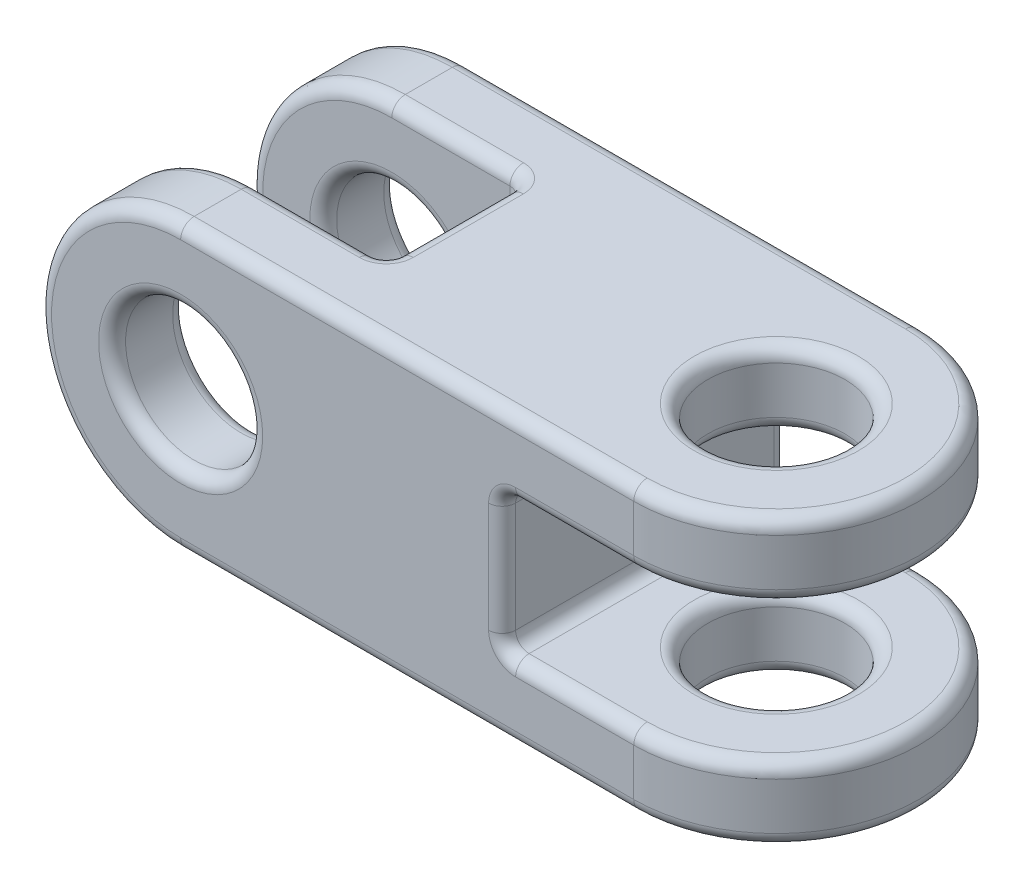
ISO-10303-21;
HEADER;
FILE_DESCRIPTION(('STEP AP214'),'2;1');
FILE_NAME('part.step','',(''),(''),'','','');
FILE_SCHEMA(('AUTOMOTIVE_DESIGN { 1 0 10303 214 1 1 1 1 }'));
ENDSEC;
DATA;
#1=APPLICATION_CONTEXT('core data for automotive mechanical design processes');
#2=APPLICATION_PROTOCOL_DEFINITION('international standard','automotive_design',2000,#1);
#3=PRODUCT_CONTEXT('',#1,'mechanical');
#4=PRODUCT('Part','Part','',(#3));
#5=PRODUCT_RELATED_PRODUCT_CATEGORY('part','',(#4));
#6=PRODUCT_DEFINITION_FORMATION('','',#4);
#7=PRODUCT_DEFINITION_CONTEXT('part definition',#1,'design');
#8=PRODUCT_DEFINITION('design','',#6,#7);
#9=PRODUCT_DEFINITION_SHAPE('','',#8);
#10=(LENGTH_UNIT() NAMED_UNIT(*) SI_UNIT(.MILLI.,.METRE.));
#11=(NAMED_UNIT(*) PLANE_ANGLE_UNIT() SI_UNIT($,.RADIAN.));
#12=(NAMED_UNIT(*) SI_UNIT($,.STERADIAN.) SOLID_ANGLE_UNIT());
#13=UNCERTAINTY_MEASURE_WITH_UNIT(LENGTH_MEASURE(1.E-05),#10,'distance_accuracy_value','');
#14=(GEOMETRIC_REPRESENTATION_CONTEXT(3) GLOBAL_UNCERTAINTY_ASSIGNED_CONTEXT((#13)) GLOBAL_UNIT_ASSIGNED_CONTEXT((#10,
#11,#12)) REPRESENTATION_CONTEXT('',''));
#15=CARTESIAN_POINT('',(0.,0.,0.));
#16=DIRECTION('',(0.,0.,1.));
#17=DIRECTION('',(1.,0.,0.));
#18=AXIS2_PLACEMENT_3D('',#15,#16,#17);
#19=CARTESIAN_POINT('',(27.2796,8.58519999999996,0.));
#20=DIRECTION('',(0.,-1.,0.));
#21=DIRECTION('',(0.,0.,-1.));
#22=AXIS2_PLACEMENT_3D('',#19,#20,#21);
#23=CYLINDRICAL_SURFACE('',#22,8.5852);
#24=DIRECTION('',(0.,-1.,0.));
#25=VECTOR('',#24,1.);
#26=CARTESIAN_POINT('',(27.2796,8.58519999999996,-8.58519999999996));
#27=LINE('',#26,#25);
#28=CARTESIAN_POINT('',(27.2796,-4.94030000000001,-8.58519999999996));
#29=VERTEX_POINT('',#28);
#30=CARTESIAN_POINT('',(27.2796,-7.77240000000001,-8.58519999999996));
#31=VERTEX_POINT('',#30);
#32=EDGE_CURVE('E562',#29,#31,#27,.T.);
#33=ORIENTED_EDGE('',*,*,#32,.F.);
#34=CARTESIAN_POINT('',(27.2796,-4.94030000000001,0.));
#35=DIRECTION('',(0.,-1.,0.));
#36=DIRECTION('',(1.,0.,0.));
#37=AXIS2_PLACEMENT_3D('',#34,#35,#36);
#38=CIRCLE('',#37,8.5852);
#39=CARTESIAN_POINT('',(27.2796,-4.94030000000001,8.58519999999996));
#40=VERTEX_POINT('',#39);
#41=EDGE_CURVE('E364',#29,#40,#38,.T.);
#42=ORIENTED_EDGE('',*,*,#41,.T.);
#43=DIRECTION('',(0.,-1.,0.));
#44=VECTOR('',#43,1.);
#45=CARTESIAN_POINT('',(27.2796,8.58519999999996,8.58519999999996));
#46=LINE('',#45,#44);
#47=CARTESIAN_POINT('',(27.2796,-7.77240000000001,8.58519999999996));
#48=VERTEX_POINT('',#47);
#49=EDGE_CURVE('E558',#40,#48,#46,.T.);
#50=ORIENTED_EDGE('',*,*,#49,.T.);
#51=CARTESIAN_POINT('',(27.2796,-7.77240000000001,0.));
#52=DIRECTION('',(0.,1.,0.));
#53=DIRECTION('',(0.,0.,1.));
#54=AXIS2_PLACEMENT_3D('',#51,#52,#53);
#55=CIRCLE('',#54,8.5852);
#56=EDGE_CURVE('E361',#48,#31,#55,.T.);
#57=ORIENTED_EDGE('',*,*,#56,.T.);
#58=EDGE_LOOP('',(#33,#42,#50,#57));
#59=FACE_BOUND('',#58,.T.);
#60=ADVANCED_FACE('F36',(#59),#23,.T.);
#61=CARTESIAN_POINT('',(27.2796,8.58519999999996,0.));
#62=DIRECTION('',(0.,-1.,0.));
#63=DIRECTION('',(0.,0.,-1.));
#64=AXIS2_PLACEMENT_3D('',#61,#62,#63);
#65=CYLINDRICAL_SURFACE('',#64,4.1275);
#66=CARTESIAN_POINT('',(27.2796,-4.94030000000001,0.));
#67=DIRECTION('',(0.,-1.,0.));
#68=DIRECTION('',(1.,0.,0.));
#69=AXIS2_PLACEMENT_3D('',#66,#67,#68);
#70=CIRCLE('',#69,4.1275);
#71=CARTESIAN_POINT('',(31.4071,-4.94030000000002,0.));
#72=VERTEX_POINT('',#71);
#73=EDGE_CURVE('E358',#72,#72,#70,.F.);
#74=ORIENTED_EDGE('',*,*,#73,.T.);
#75=EDGE_LOOP('',(#74));
#76=FACE_BOUND('',#75,.T.);
#77=CARTESIAN_POINT('',(27.2796,-7.77240000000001,0.));
#78=DIRECTION('',(0.,1.,0.));
#79=DIRECTION('',(0.,0.,1.));
#80=AXIS2_PLACEMENT_3D('',#77,#78,#79);
#81=CIRCLE('',#80,4.1275);
#82=CARTESIAN_POINT('',(27.2796,-7.77240000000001,4.1275));
#83=VERTEX_POINT('',#82);
#84=EDGE_CURVE('E355',#83,#83,#81,.F.);
#85=ORIENTED_EDGE('',*,*,#84,.T.);
#86=EDGE_LOOP('',(#85));
#87=FACE_BOUND('',#86,.T.);
#88=ADVANCED_FACE('F738',(#76,#87),#65,.F.);
#89=CARTESIAN_POINT('',(0.,0.,8.58519999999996));
#90=DIRECTION('',(0.,0.,-1.));
#91=DIRECTION('',(-1.,0.,0.));
#92=AXIS2_PLACEMENT_3D('',#89,#90,#91);
#93=CYLINDRICAL_SURFACE('',#92,8.5852);
#94=DIRECTION('',(0.,0.,-1.));
#95=VECTOR('',#94,1.);
#96=CARTESIAN_POINT('',(0.,-8.58520000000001,8.58519999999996));
#97=LINE('',#96,#95);
#98=CARTESIAN_POINT('',(0.,-8.58520000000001,-4.94030000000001));
#99=VERTEX_POINT('',#98);
#100=CARTESIAN_POINT('',(0.,-8.58520000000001,-7.77240000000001));
#101=VERTEX_POINT('',#100);
#102=EDGE_CURVE('E273',#99,#101,#97,.T.);
#103=ORIENTED_EDGE('',*,*,#102,.F.);
#104=CARTESIAN_POINT('',(0.,0.,-4.94030000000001));
#105=DIRECTION('',(0.,0.,-1.));
#106=DIRECTION('',(-1.,0.,0.));
#107=AXIS2_PLACEMENT_3D('',#104,#105,#106);
#108=CIRCLE('',#107,8.5852);
#109=CARTESIAN_POINT('',(0.,8.58520000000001,-4.94030000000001));
#110=VERTEX_POINT('',#109);
#111=EDGE_CURVE('E11',#99,#110,#108,.T.);
#112=ORIENTED_EDGE('',*,*,#111,.T.);
#113=DIRECTION('',(0.,0.,-1.));
#114=VECTOR('',#113,1.);
#115=CARTESIAN_POINT('',(0.,8.58520000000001,8.58519999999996));
#116=LINE('',#115,#114);
#117=CARTESIAN_POINT('',(0.,8.58520000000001,-7.77240000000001));
#118=VERTEX_POINT('',#117);
#119=EDGE_CURVE('E463',#110,#118,#116,.T.);
#120=ORIENTED_EDGE('',*,*,#119,.T.);
#121=CARTESIAN_POINT('',(0.,0.,-7.77240000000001));
#122=DIRECTION('',(0.,0.,1.));
#123=DIRECTION('',(1.,0.,0.));
#124=AXIS2_PLACEMENT_3D('',#121,#122,#123);
#125=CIRCLE('',#124,8.5852);
#126=EDGE_CURVE('E44',#118,#101,#125,.T.);
#127=ORIENTED_EDGE('',*,*,#126,.T.);
#128=EDGE_LOOP('',(#103,#112,#120,#127));
#129=FACE_BOUND('',#128,.T.);
#130=ADVANCED_FACE('F460',(#129),#93,.T.);
#131=CARTESIAN_POINT('',(0.,0.,8.58519999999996));
#132=DIRECTION('',(0.,0.,-1.));
#133=DIRECTION('',(-1.,0.,0.));
#134=AXIS2_PLACEMENT_3D('',#131,#132,#133);
#135=CYLINDRICAL_SURFACE('',#134,4.1275);
#136=CARTESIAN_POINT('',(0.,0.,-4.94030000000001));
#137=DIRECTION('',(0.,0.,-1.));
#138=DIRECTION('',(-1.,0.,0.));
#139=AXIS2_PLACEMENT_3D('',#136,#137,#138);
#140=CIRCLE('',#139,4.1275);
#141=CARTESIAN_POINT('',(-4.1275,0.,-4.94030000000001));
#142=VERTEX_POINT('',#141);
#143=EDGE_CURVE('E453',#142,#142,#140,.F.);
#144=ORIENTED_EDGE('',*,*,#143,.T.);
#145=EDGE_LOOP('',(#144));
#146=FACE_BOUND('',#145,.T.);
#147=CARTESIAN_POINT('',(0.,0.,-7.77240000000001));
#148=DIRECTION('',(0.,0.,1.));
#149=DIRECTION('',(1.,0.,0.));
#150=AXIS2_PLACEMENT_3D('',#147,#148,#149);
#151=CIRCLE('',#150,4.1275);
#152=CARTESIAN_POINT('',(4.1275,0.,-7.77240000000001));
#153=VERTEX_POINT('',#152);
#154=EDGE_CURVE('E450',#153,#153,#151,.F.);
#155=ORIENTED_EDGE('',*,*,#154,.T.);
#156=EDGE_LOOP('',(#155));
#157=FACE_BOUND('',#156,.T.);
#158=ADVANCED_FACE('F767',(#146,#157),#135,.F.);
#159=CARTESIAN_POINT('',(0.,0.,8.58519999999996));
#160=DIRECTION('',(0.,0.,1.));
#161=DIRECTION('',(1.,0.,0.));
#162=AXIS2_PLACEMENT_3D('',#159,#160,#161);
#163=PLANE('',#162);
#164=CARTESIAN_POINT('',(0.,0.,8.58519999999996));
#165=DIRECTION('',(0.,0.,1.));
#166=DIRECTION('',(1.,0.,0.));
#167=AXIS2_PLACEMENT_3D('',#164,#165,#166);
#168=CIRCLE('',#167,4.9403);
#169=CARTESIAN_POINT('',(4.9403,0.,8.58519999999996));
#170=VERTEX_POINT('',#169);
#171=EDGE_CURVE('E331',#170,#170,#168,.F.);
#172=ORIENTED_EDGE('',*,*,#171,.T.);
#173=EDGE_LOOP('',(#172));
#174=FACE_BOUND('',#173,.T.);
#175=ORIENTED_EDGE('',*,*,#49,.F.);
#176=DIRECTION('',(-1.,0.,0.));
#177=VECTOR('',#176,1.);
#178=CARTESIAN_POINT('',(19.3548,-4.94030000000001,8.58519999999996));
#179=LINE('',#178,#177);
#180=CARTESIAN_POINT('',(20.1676,-4.94030000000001,8.58519999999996));
#181=VERTEX_POINT('',#180);
#182=EDGE_CURVE('E261',#40,#181,#179,.T.);
#183=ORIENTED_EDGE('',*,*,#182,.T.);
#184=CARTESIAN_POINT('',(20.1676,-3.3147,8.58519999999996));
#185=DIRECTION('',(0.,0.,1.));
#186=DIRECTION('',(1.,0.,0.));
#187=AXIS2_PLACEMENT_3D('',#184,#185,#186);
#188=CIRCLE('',#187,1.6256);
#189=CARTESIAN_POINT('',(18.542,-3.3147,8.58519999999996));
#190=VERTEX_POINT('',#189);
#191=EDGE_CURVE('E341',#190,#181,#188,.T.);
#192=ORIENTED_EDGE('',*,*,#191,.F.);
#193=DIRECTION('',(0.,1.,0.));
#194=VECTOR('',#193,1.);
#195=CARTESIAN_POINT('',(18.542,4.12750000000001,8.58519999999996));
#196=LINE('',#195,#194);
#197=CARTESIAN_POINT('',(18.542,3.3147,8.58519999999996));
#198=VERTEX_POINT('',#197);
#199=EDGE_CURVE('E339',#190,#198,#196,.T.);
#200=ORIENTED_EDGE('',*,*,#199,.T.);
#201=CARTESIAN_POINT('',(20.1676,3.3147,8.58519999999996));
#202=DIRECTION('',(0.,0.,1.));
#203=DIRECTION('',(1.,0.,0.));
#204=AXIS2_PLACEMENT_3D('',#201,#202,#203);
#205=CIRCLE('',#204,1.6256);
#206=CARTESIAN_POINT('',(20.1676,4.94030000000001,8.58519999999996));
#207=VERTEX_POINT('',#206);
#208=EDGE_CURVE('E336',#207,#198,#205,.T.);
#209=ORIENTED_EDGE('',*,*,#208,.F.);
#210=DIRECTION('',(1.,0.,0.));
#211=VECTOR('',#210,1.);
#212=CARTESIAN_POINT('',(27.2796,4.94030000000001,8.58519999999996));
#213=LINE('',#212,#211);
#214=CARTESIAN_POINT('',(27.2796,4.94030000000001,8.58519999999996));
#215=VERTEX_POINT('',#214);
#216=EDGE_CURVE('E334',#207,#215,#213,.T.);
#217=ORIENTED_EDGE('',*,*,#216,.T.);
#218=CARTESIAN_POINT('',(27.2796,7.77240000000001,8.58519999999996));
#219=VERTEX_POINT('',#218);
#220=EDGE_CURVE('E564',#219,#215,#46,.T.);
#221=ORIENTED_EDGE('',*,*,#220,.F.);
#222=DIRECTION('',(-1.,0.,0.));
#223=VECTOR('',#222,1.);
#224=CARTESIAN_POINT('',(0.,7.77240000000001,8.58519999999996));
#225=LINE('',#224,#223);
#226=CARTESIAN_POINT('',(0.,7.77240000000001,8.58519999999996));
#227=VERTEX_POINT('',#226);
#228=EDGE_CURVE('E325',#219,#227,#225,.T.);
#229=ORIENTED_EDGE('',*,*,#228,.T.);
#230=CARTESIAN_POINT('',(0.,0.,8.58519999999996));
#231=DIRECTION('',(0.,0.,1.));
#232=DIRECTION('',(1.,0.,0.));
#233=AXIS2_PLACEMENT_3D('',#230,#231,#232);
#234=CIRCLE('',#233,7.7724);
#235=CARTESIAN_POINT('',(0.,-7.77240000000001,8.58519999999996));
#236=VERTEX_POINT('',#235);
#237=EDGE_CURVE('E327',#227,#236,#234,.T.);
#238=ORIENTED_EDGE('',*,*,#237,.T.);
#239=DIRECTION('',(1.,0.,0.));
#240=VECTOR('',#239,1.);
#241=CARTESIAN_POINT('',(27.2796,-7.77240000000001,8.58519999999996));
#242=LINE('',#241,#240);
#243=EDGE_CURVE('E329',#236,#48,#242,.T.);
#244=ORIENTED_EDGE('',*,*,#243,.T.);
#245=EDGE_LOOP('',(#175,#183,#192,#200,#209,#217,#221,#229,#238,#244));
#246=FACE_BOUND('',#245,.T.);
#247=ADVANCED_FACE('F667',(#174,#246),#163,.T.);
#248=CARTESIAN_POINT('',(0.,0.,-8.58519999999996));
#249=DIRECTION('',(0.,0.,1.));
#250=DIRECTION('',(1.,0.,0.));
#251=AXIS2_PLACEMENT_3D('',#248,#249,#250);
#252=PLANE('',#251);
#253=CARTESIAN_POINT('',(0.,0.,-8.58519999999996));
#254=DIRECTION('',(0.,0.,1.));
#255=DIRECTION('',(1.,0.,0.));
#256=AXIS2_PLACEMENT_3D('',#253,#254,#255);
#257=CIRCLE('',#256,4.9403);
#258=CARTESIAN_POINT('',(4.9403,0.,-8.58519999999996));
#259=VERTEX_POINT('',#258);
#260=EDGE_CURVE('E288',#259,#259,#257,.T.);
#261=ORIENTED_EDGE('',*,*,#260,.T.);
#262=EDGE_LOOP('',(#261));
#263=FACE_BOUND('',#262,.T.);
#264=CARTESIAN_POINT('',(20.1676,-3.3147,-8.58519999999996));
#265=DIRECTION('',(0.,0.,1.));
#266=DIRECTION('',(1.,0.,0.));
#267=AXIS2_PLACEMENT_3D('',#264,#265,#266);
#268=CIRCLE('',#267,1.6256);
#269=CARTESIAN_POINT('',(20.1676,-4.94030000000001,-8.58519999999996));
#270=VERTEX_POINT('',#269);
#271=CARTESIAN_POINT('',(18.542,-3.3147,-8.58519999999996));
#272=VERTEX_POINT('',#271);
#273=EDGE_CURVE('E298',#270,#272,#268,.F.);
#274=ORIENTED_EDGE('',*,*,#273,.F.);
#275=DIRECTION('',(-1.,0.,0.));
#276=VECTOR('',#275,1.);
#277=CARTESIAN_POINT('',(0.,-4.94030000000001,-8.58519999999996));
#278=LINE('',#277,#276);
#279=EDGE_CURVE('E301',#270,#29,#278,.F.);
#280=ORIENTED_EDGE('',*,*,#279,.T.);
#281=ORIENTED_EDGE('',*,*,#32,.T.);
#282=DIRECTION('',(1.,0.,0.));
#283=VECTOR('',#282,1.);
#284=CARTESIAN_POINT('',(0.,-7.77240000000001,-8.58519999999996));
#285=LINE('',#284,#283);
#286=CARTESIAN_POINT('',(0.,-7.77240000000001,-8.58519999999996));
#287=VERTEX_POINT('',#286);
#288=EDGE_CURVE('E286',#31,#287,#285,.F.);
#289=ORIENTED_EDGE('',*,*,#288,.T.);
#290=CARTESIAN_POINT('',(0.,0.,-8.58519999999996));
#291=DIRECTION('',(0.,0.,1.));
#292=DIRECTION('',(1.,0.,0.));
#293=AXIS2_PLACEMENT_3D('',#290,#291,#292);
#294=CIRCLE('',#293,7.7724);
#295=CARTESIAN_POINT('',(0.,7.77240000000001,-8.58519999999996));
#296=VERTEX_POINT('',#295);
#297=EDGE_CURVE('E284',#287,#296,#294,.F.);
#298=ORIENTED_EDGE('',*,*,#297,.T.);
#299=DIRECTION('',(-1.,0.,0.));
#300=VECTOR('',#299,1.);
#301=CARTESIAN_POINT('',(0.,7.77240000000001,-8.58519999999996));
#302=LINE('',#301,#300);
#303=CARTESIAN_POINT('',(27.2796,7.77240000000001,-8.58519999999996));
#304=VERTEX_POINT('',#303);
#305=EDGE_CURVE('E282',#296,#304,#302,.F.);
#306=ORIENTED_EDGE('',*,*,#305,.T.);
#307=CARTESIAN_POINT('',(27.2796,4.94030000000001,-8.58519999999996));
#308=VERTEX_POINT('',#307);
#309=EDGE_CURVE('E559',#304,#308,#27,.T.);
#310=ORIENTED_EDGE('',*,*,#309,.T.);
#311=DIRECTION('',(1.,0.,0.));
#312=VECTOR('',#311,1.);
#313=CARTESIAN_POINT('',(0.,4.94030000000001,-8.58519999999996));
#314=LINE('',#313,#312);
#315=CARTESIAN_POINT('',(20.1676,4.94030000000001,-8.58519999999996));
#316=VERTEX_POINT('',#315);
#317=EDGE_CURVE('E294',#308,#316,#314,.F.);
#318=ORIENTED_EDGE('',*,*,#317,.T.);
#319=CARTESIAN_POINT('',(20.1676,3.3147,-8.58519999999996));
#320=DIRECTION('',(0.,0.,1.));
#321=DIRECTION('',(1.,0.,0.));
#322=AXIS2_PLACEMENT_3D('',#319,#320,#321);
#323=CIRCLE('',#322,1.6256);
#324=CARTESIAN_POINT('',(18.542,3.3147,-8.58519999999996));
#325=VERTEX_POINT('',#324);
#326=EDGE_CURVE('E291',#325,#316,#323,.F.);
#327=ORIENTED_EDGE('',*,*,#326,.F.);
#328=DIRECTION('',(0.,1.,0.));
#329=VECTOR('',#328,1.);
#330=CARTESIAN_POINT('',(18.542,0.,-8.58519999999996));
#331=LINE('',#330,#329);
#332=EDGE_CURVE('E296',#325,#272,#331,.F.);
#333=ORIENTED_EDGE('',*,*,#332,.T.);
#334=EDGE_LOOP('',(#274,#280,#281,#289,#298,#306,#310,#318,#327,#333));
#335=FACE_BOUND('',#334,.T.);
#336=ADVANCED_FACE('F651',(#263,#335),#252,.F.);
#337=CARTESIAN_POINT('',(0.,8.58520000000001,7.77240000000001));
#338=VERTEX_POINT('',#337);
#339=CARTESIAN_POINT('',(0.,8.58520000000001,4.94030000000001));
#340=VERTEX_POINT('',#339);
#341=EDGE_CURVE('E473',#338,#340,#116,.T.);
#342=ORIENTED_EDGE('',*,*,#341,.T.);
#343=CARTESIAN_POINT('',(0.,0.,4.94030000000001));
#344=DIRECTION('',(0.,0.,1.));
#345=DIRECTION('',(1.,0.,0.));
#346=AXIS2_PLACEMENT_3D('',#343,#344,#345);
#347=CIRCLE('',#346,8.5852);
#348=CARTESIAN_POINT('',(0.,-8.58520000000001,4.94030000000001));
#349=VERTEX_POINT('',#348);
#350=EDGE_CURVE('E448',#340,#349,#347,.T.);
#351=ORIENTED_EDGE('',*,*,#350,.T.);
#352=CARTESIAN_POINT('',(0.,-8.58520000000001,7.77240000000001));
#353=VERTEX_POINT('',#352);
#354=EDGE_CURVE('E270',#353,#349,#97,.T.);
#355=ORIENTED_EDGE('',*,*,#354,.F.);
#356=CARTESIAN_POINT('',(0.,0.,7.77240000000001));
#357=DIRECTION('',(0.,0.,1.));
#358=DIRECTION('',(1.,0.,0.));
#359=AXIS2_PLACEMENT_3D('',#356,#357,#358);
#360=CIRCLE('',#359,8.5852);
#361=EDGE_CURVE('E446',#353,#338,#360,.F.);
#362=ORIENTED_EDGE('',*,*,#361,.T.);
#363=EDGE_LOOP('',(#342,#351,#355,#362));
#364=FACE_BOUND('',#363,.T.);
#365=ADVANCED_FACE('F38',(#364),#93,.T.);
#366=CARTESIAN_POINT('',(0.,-8.58520000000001,8.58519999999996));
#367=DIRECTION('',(0.,1.,0.));
#368=DIRECTION('',(0.,0.,1.));
#369=AXIS2_PLACEMENT_3D('',#366,#367,#368);
#370=PLANE('',#369);
#371=CARTESIAN_POINT('',(27.2796,-8.58520000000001,0.));
#372=DIRECTION('',(0.,1.,0.));
#373=DIRECTION('',(0.,0.,1.));
#374=AXIS2_PLACEMENT_3D('',#371,#372,#373);
#375=CIRCLE('',#374,4.9403);
#376=CARTESIAN_POINT('',(27.2796,-8.58520000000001,4.9403));
#377=VERTEX_POINT('',#376);
#378=EDGE_CURVE('E385',#377,#377,#375,.T.);
#379=ORIENTED_EDGE('',*,*,#378,.T.);
#380=EDGE_LOOP('',(#379));
#381=FACE_BOUND('',#380,.T.);
#382=CARTESIAN_POINT('',(7.11200000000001,-8.58520000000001,-3.3147));
#383=DIRECTION('',(0.,1.,0.));
#384=DIRECTION('',(0.,0.,1.));
#385=AXIS2_PLACEMENT_3D('',#382,#383,#384);
#386=CIRCLE('',#385,1.6256);
#387=CARTESIAN_POINT('',(7.11200000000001,-8.58520000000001,-4.94030000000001));
#388=VERTEX_POINT('',#387);
#389=CARTESIAN_POINT('',(8.73760000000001,-8.58520000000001,-3.3147));
#390=VERTEX_POINT('',#389);
#391=EDGE_CURVE('E373',#388,#390,#386,.F.);
#392=ORIENTED_EDGE('',*,*,#391,.F.);
#393=DIRECTION('',(-1.,0.,0.));
#394=VECTOR('',#393,1.);
#395=CARTESIAN_POINT('',(0.,-8.58520000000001,-4.94030000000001));
#396=LINE('',#395,#394);
#397=EDGE_CURVE('E383',#388,#99,#396,.T.);
#398=ORIENTED_EDGE('',*,*,#397,.T.);
#399=ORIENTED_EDGE('',*,*,#102,.T.);
#400=DIRECTION('',(1.,0.,0.));
#401=VECTOR('',#400,1.);
#402=CARTESIAN_POINT('',(0.,-8.58520000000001,-7.77240000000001));
#403=LINE('',#402,#401);
#404=CARTESIAN_POINT('',(27.2796,-8.58520000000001,-7.77240000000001));
#405=VERTEX_POINT('',#404);
#406=EDGE_CURVE('E371',#101,#405,#403,.T.);
#407=ORIENTED_EDGE('',*,*,#406,.T.);
#408=CARTESIAN_POINT('',(27.2796,-8.58520000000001,0.));
#409=DIRECTION('',(0.,1.,0.));
#410=DIRECTION('',(0.,0.,1.));
#411=AXIS2_PLACEMENT_3D('',#408,#409,#410);
#412=CIRCLE('',#411,7.7724);
#413=CARTESIAN_POINT('',(27.2796,-8.58520000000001,7.77240000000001));
#414=VERTEX_POINT('',#413);
#415=EDGE_CURVE('E368',#405,#414,#412,.F.);
#416=ORIENTED_EDGE('',*,*,#415,.T.);
#417=DIRECTION('',(1.,0.,0.));
#418=VECTOR('',#417,1.);
#419=CARTESIAN_POINT('',(0.,-8.58520000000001,7.77240000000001));
#420=LINE('',#419,#418);
#421=EDGE_CURVE('E366',#414,#353,#420,.F.);
#422=ORIENTED_EDGE('',*,*,#421,.T.);
#423=ORIENTED_EDGE('',*,*,#354,.T.);
#424=DIRECTION('',(1.,0.,0.));
#425=VECTOR('',#424,1.);
#426=CARTESIAN_POINT('',(0.,-8.58520000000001,4.94030000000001));
#427=LINE('',#426,#425);
#428=CARTESIAN_POINT('',(7.11200000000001,-8.58520000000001,4.94030000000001));
#429=VERTEX_POINT('',#428);
#430=EDGE_CURVE('E381',#349,#429,#427,.T.);
#431=ORIENTED_EDGE('',*,*,#430,.T.);
#432=CARTESIAN_POINT('',(7.11200000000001,-8.58520000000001,3.3147));
#433=DIRECTION('',(0.,1.,0.));
#434=DIRECTION('',(0.,0.,1.));
#435=AXIS2_PLACEMENT_3D('',#432,#433,#434);
#436=CIRCLE('',#435,1.6256);
#437=CARTESIAN_POINT('',(8.73760000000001,-8.58520000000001,3.3147));
#438=VERTEX_POINT('',#437);
#439=EDGE_CURVE('E378',#438,#429,#436,.F.);
#440=ORIENTED_EDGE('',*,*,#439,.F.);
#441=DIRECTION('',(0.,0.,-1.));
#442=VECTOR('',#441,1.);
#443=CARTESIAN_POINT('',(8.73760000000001,-8.58520000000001,8.58519999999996));
#444=LINE('',#443,#442);
#445=EDGE_CURVE('E376',#438,#390,#444,.T.);
#446=ORIENTED_EDGE('',*,*,#445,.T.);
#447=EDGE_LOOP('',(#392,#398,#399,#407,#416,#422,#423,#431,#440,#446));
#448=FACE_BOUND('',#447,.T.);
#449=ADVANCED_FACE('F469',(#381,#448),#370,.F.);
#450=CARTESIAN_POINT('',(13.6398,8.58520000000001,8.58519999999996));
#451=DIRECTION('',(0.,-1.,0.));
#452=DIRECTION('',(0.,0.,-1.));
#453=AXIS2_PLACEMENT_3D('',#450,#451,#452);
#454=PLANE('',#453);
#455=CARTESIAN_POINT('',(27.2796,8.58520000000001,0.));
#456=DIRECTION('',(0.,-1.,0.));
#457=DIRECTION('',(0.,0.,-1.));
#458=AXIS2_PLACEMENT_3D('',#455,#456,#457);
#459=CIRCLE('',#458,4.9403);
#460=CARTESIAN_POINT('',(27.2796,8.58520000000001,-4.9403));
#461=VERTEX_POINT('',#460);
#462=EDGE_CURVE('E407',#461,#461,#459,.T.);
#463=ORIENTED_EDGE('',*,*,#462,.T.);
#464=EDGE_LOOP('',(#463));
#465=FACE_BOUND('',#464,.T.);
#466=ORIENTED_EDGE('',*,*,#119,.F.);
#467=DIRECTION('',(-1.,0.,0.));
#468=VECTOR('',#467,1.);
#469=CARTESIAN_POINT('',(13.6398,8.58520000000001,-4.94030000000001));
#470=LINE('',#469,#468);
#471=CARTESIAN_POINT('',(7.11200000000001,8.58520000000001,-4.94030000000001));
#472=VERTEX_POINT('',#471);
#473=EDGE_CURVE('E404',#110,#472,#470,.F.);
#474=ORIENTED_EDGE('',*,*,#473,.T.);
#475=CARTESIAN_POINT('',(7.11200000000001,8.58520000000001,-3.3147));
#476=DIRECTION('',(0.,-1.,0.));
#477=DIRECTION('',(0.,0.,-1.));
#478=AXIS2_PLACEMENT_3D('',#475,#476,#477);
#479=CIRCLE('',#478,1.6256);
#480=CARTESIAN_POINT('',(8.73759999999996,8.58520000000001,-3.3147));
#481=VERTEX_POINT('',#480);
#482=EDGE_CURVE('E401',#481,#472,#479,.F.);
#483=ORIENTED_EDGE('',*,*,#482,.F.);
#484=DIRECTION('',(0.,0.,-1.));
#485=VECTOR('',#484,1.);
#486=CARTESIAN_POINT('',(8.73760000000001,8.58520000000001,8.58519999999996));
#487=LINE('',#486,#485);
#488=CARTESIAN_POINT('',(8.73760000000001,8.58520000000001,3.3147));
#489=VERTEX_POINT('',#488);
#490=EDGE_CURVE('E397',#481,#489,#487,.F.);
#491=ORIENTED_EDGE('',*,*,#490,.T.);
#492=CARTESIAN_POINT('',(7.11200000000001,8.58520000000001,3.3147));
#493=DIRECTION('',(0.,-1.,0.));
#494=DIRECTION('',(0.,0.,-1.));
#495=AXIS2_PLACEMENT_3D('',#492,#493,#494);
#496=CIRCLE('',#495,1.6256);
#497=CARTESIAN_POINT('',(7.11200000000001,8.58520000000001,4.94030000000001));
#498=VERTEX_POINT('',#497);
#499=EDGE_CURVE('E394',#498,#489,#496,.F.);
#500=ORIENTED_EDGE('',*,*,#499,.F.);
#501=DIRECTION('',(1.,0.,0.));
#502=VECTOR('',#501,1.);
#503=CARTESIAN_POINT('',(13.6398,8.58520000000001,4.94030000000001));
#504=LINE('',#503,#502);
#505=EDGE_CURVE('E399',#498,#340,#504,.F.);
#506=ORIENTED_EDGE('',*,*,#505,.T.);
#507=ORIENTED_EDGE('',*,*,#341,.F.);
#508=DIRECTION('',(-1.,0.,0.));
#509=VECTOR('',#508,1.);
#510=CARTESIAN_POINT('',(27.2796,8.58520000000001,7.77240000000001));
#511=LINE('',#510,#509);
#512=CARTESIAN_POINT('',(27.2796,8.58520000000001,7.77240000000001));
#513=VERTEX_POINT('',#512);
#514=EDGE_CURVE('E388',#338,#513,#511,.F.);
#515=ORIENTED_EDGE('',*,*,#514,.T.);
#516=CARTESIAN_POINT('',(27.2796,8.58520000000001,0.));
#517=DIRECTION('',(0.,-1.,0.));
#518=DIRECTION('',(0.,0.,-1.));
#519=AXIS2_PLACEMENT_3D('',#516,#517,#518);
#520=CIRCLE('',#519,7.7724);
#521=CARTESIAN_POINT('',(27.2796,8.58520000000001,-7.77240000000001));
#522=VERTEX_POINT('',#521);
#523=EDGE_CURVE('E390',#513,#522,#520,.F.);
#524=ORIENTED_EDGE('',*,*,#523,.T.);
#525=DIRECTION('',(-1.,0.,0.));
#526=VECTOR('',#525,1.);
#527=CARTESIAN_POINT('',(13.6398,8.58520000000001,-7.77240000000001));
#528=LINE('',#527,#526);
#529=EDGE_CURVE('E392',#522,#118,#528,.T.);
#530=ORIENTED_EDGE('',*,*,#529,.T.);
#531=EDGE_LOOP('',(#466,#474,#483,#491,#500,#506,#507,#515,#524,#530));
#532=FACE_BOUND('',#531,.T.);
#533=ADVANCED_FACE('F642',(#465,#532),#454,.F.);
#534=CARTESIAN_POINT('',(0.,0.,4.94030000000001));
#535=DIRECTION('',(0.,0.,1.));
#536=DIRECTION('',(1.,0.,0.));
#537=AXIS2_PLACEMENT_3D('',#534,#535,#536);
#538=CIRCLE('',#537,4.1275);
#539=CARTESIAN_POINT('',(4.1275,0.,4.94030000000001));
#540=VERTEX_POINT('',#539);
#541=EDGE_CURVE('E443',#540,#540,#538,.F.);
#542=ORIENTED_EDGE('',*,*,#541,.T.);
#543=EDGE_LOOP('',(#542));
#544=FACE_BOUND('',#543,.T.);
#545=CARTESIAN_POINT('',(0.,0.,7.77240000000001));
#546=DIRECTION('',(0.,0.,1.));
#547=DIRECTION('',(1.,0.,0.));
#548=AXIS2_PLACEMENT_3D('',#545,#546,#547);
#549=CIRCLE('',#548,4.1275);
#550=CARTESIAN_POINT('',(4.1275,0.,7.77240000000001));
#551=VERTEX_POINT('',#550);
#552=EDGE_CURVE('E440',#551,#551,#549,.T.);
#553=ORIENTED_EDGE('',*,*,#552,.T.);
#554=EDGE_LOOP('',(#553));
#555=FACE_BOUND('',#554,.T.);
#556=ADVANCED_FACE('F762',(#544,#555),#135,.F.);
#557=CARTESIAN_POINT('',(-8.58520000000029,-8.58520000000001,-4.12749999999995));
#558=DIRECTION('',(0.,0.,-1.));
#559=DIRECTION('',(-1.,0.,0.));
#560=AXIS2_PLACEMENT_3D('',#557,#558,#559);
#561=PLANE('',#560);
#562=CARTESIAN_POINT('',(0.,0.,-4.12749999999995));
#563=DIRECTION('',(0.,0.,-1.));
#564=DIRECTION('',(-1.,0.,0.));
#565=AXIS2_PLACEMENT_3D('',#562,#563,#564);
#566=CIRCLE('',#565,4.9403);
#567=CARTESIAN_POINT('',(-4.9403,0.,-4.12749999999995));
#568=VERTEX_POINT('',#567);
#569=EDGE_CURVE('E419',#568,#568,#566,.T.);
#570=ORIENTED_EDGE('',*,*,#569,.T.);
#571=EDGE_LOOP('',(#570));
#572=FACE_BOUND('',#571,.T.);
#573=DIRECTION('',(-1.,0.,0.));
#574=VECTOR('',#573,1.);
#575=CARTESIAN_POINT('',(-8.58520000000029,-7.77240000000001,-4.12749999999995));
#576=LINE('',#575,#574);
#577=CARTESIAN_POINT('',(0.,-7.77240000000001,-4.12749999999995));
#578=VERTEX_POINT('',#577);
#579=CARTESIAN_POINT('',(7.11200000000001,-7.77240000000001,-4.12749999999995));
#580=VERTEX_POINT('',#579);
#581=EDGE_CURVE('E412',#578,#580,#576,.F.);
#582=ORIENTED_EDGE('',*,*,#581,.T.);
#583=DIRECTION('',(0.,1.,0.));
#584=VECTOR('',#583,1.);
#585=CARTESIAN_POINT('',(7.11200000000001,8.58520000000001,-4.12749999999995));
#586=LINE('',#585,#584);
#587=CARTESIAN_POINT('',(7.11200000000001,7.77240000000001,-4.12749999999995));
#588=VERTEX_POINT('',#587);
#589=EDGE_CURVE('E417',#580,#588,#586,.T.);
#590=ORIENTED_EDGE('',*,*,#589,.T.);
#591=DIRECTION('',(-1.,0.,0.));
#592=VECTOR('',#591,1.);
#593=CARTESIAN_POINT('',(-8.58520000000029,7.77240000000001,-4.12749999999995));
#594=LINE('',#593,#592);
#595=CARTESIAN_POINT('',(0.,7.77240000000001,-4.12749999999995));
#596=VERTEX_POINT('',#595);
#597=EDGE_CURVE('E414',#588,#596,#594,.T.);
#598=ORIENTED_EDGE('',*,*,#597,.T.);
#599=CARTESIAN_POINT('',(0.,0.,-4.12749999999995));
#600=DIRECTION('',(0.,0.,-1.));
#601=DIRECTION('',(-1.,0.,0.));
#602=AXIS2_PLACEMENT_3D('',#599,#600,#601);
#603=CIRCLE('',#602,7.7724);
#604=EDGE_CURVE('E410',#596,#578,#603,.F.);
#605=ORIENTED_EDGE('',*,*,#604,.T.);
#606=EDGE_LOOP('',(#582,#590,#598,#605));
#607=FACE_BOUND('',#606,.T.);
#608=ADVANCED_FACE('F631',(#572,#607),#561,.F.);
#609=CARTESIAN_POINT('',(-8.58520000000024,-8.58520000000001,4.12749999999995));
#610=DIRECTION('',(0.,0.,1.));
#611=DIRECTION('',(1.,0.,0.));
#612=AXIS2_PLACEMENT_3D('',#609,#610,#611);
#613=PLANE('',#612);
#614=CARTESIAN_POINT('',(0.,0.,4.12749999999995));
#615=DIRECTION('',(0.,0.,1.));
#616=DIRECTION('',(1.,0.,0.));
#617=AXIS2_PLACEMENT_3D('',#614,#615,#616);
#618=CIRCLE('',#617,4.9403);
#619=CARTESIAN_POINT('',(4.9403,0.,4.12749999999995));
#620=VERTEX_POINT('',#619);
#621=EDGE_CURVE('E431',#620,#620,#618,.T.);
#622=ORIENTED_EDGE('',*,*,#621,.T.);
#623=EDGE_LOOP('',(#622));
#624=FACE_BOUND('',#623,.T.);
#625=DIRECTION('',(1.,0.,0.));
#626=VECTOR('',#625,1.);
#627=CARTESIAN_POINT('',(-8.58520000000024,7.77240000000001,4.12749999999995));
#628=LINE('',#627,#626);
#629=CARTESIAN_POINT('',(0.,7.77240000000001,4.12749999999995));
#630=VERTEX_POINT('',#629);
#631=CARTESIAN_POINT('',(7.11200000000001,7.77240000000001,4.12749999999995));
#632=VERTEX_POINT('',#631);
#633=EDGE_CURVE('E426',#630,#632,#628,.T.);
#634=ORIENTED_EDGE('',*,*,#633,.T.);
#635=DIRECTION('',(0.,1.,0.));
#636=VECTOR('',#635,1.);
#637=CARTESIAN_POINT('',(7.11200000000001,-8.58520000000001,4.12749999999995));
#638=LINE('',#637,#636);
#639=CARTESIAN_POINT('',(7.11200000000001,-7.77240000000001,4.12749999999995));
#640=VERTEX_POINT('',#639);
#641=EDGE_CURVE('E429',#632,#640,#638,.F.);
#642=ORIENTED_EDGE('',*,*,#641,.T.);
#643=DIRECTION('',(1.,0.,0.));
#644=VECTOR('',#643,1.);
#645=CARTESIAN_POINT('',(-8.58520000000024,-7.77240000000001,4.12749999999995));
#646=LINE('',#645,#644);
#647=CARTESIAN_POINT('',(0.,-7.77240000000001,4.12749999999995));
#648=VERTEX_POINT('',#647);
#649=EDGE_CURVE('E424',#640,#648,#646,.F.);
#650=ORIENTED_EDGE('',*,*,#649,.T.);
#651=CARTESIAN_POINT('',(0.,0.,4.12749999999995));
#652=DIRECTION('',(0.,0.,1.));
#653=DIRECTION('',(1.,0.,0.));
#654=AXIS2_PLACEMENT_3D('',#651,#652,#653);
#655=CIRCLE('',#654,7.7724);
#656=EDGE_CURVE('E422',#648,#630,#655,.F.);
#657=ORIENTED_EDGE('',*,*,#656,.T.);
#658=EDGE_LOOP('',(#634,#642,#650,#657));
#659=FACE_BOUND('',#658,.T.);
#660=ADVANCED_FACE('F753',(#624,#659),#613,.F.);
#661=CARTESIAN_POINT('',(7.92480000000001,-8.58520000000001,-4.12750000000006));
#662=DIRECTION('',(1.,0.,0.));
#663=DIRECTION('',(0.,1.,0.));
#664=AXIS2_PLACEMENT_3D('',#661,#662,#663);
#665=PLANE('',#664);
#666=DIRECTION('',(0.,0.,-1.));
#667=VECTOR('',#666,1.);
#668=CARTESIAN_POINT('',(7.92480000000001,-7.77240000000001,-4.12750000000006));
#669=LINE('',#668,#667);
#670=CARTESIAN_POINT('',(7.92480000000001,-7.77240000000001,-3.3147));
#671=VERTEX_POINT('',#670);
#672=CARTESIAN_POINT('',(7.92480000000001,-7.77240000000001,3.3147));
#673=VERTEX_POINT('',#672);
#674=EDGE_CURVE('E56',#671,#673,#669,.F.);
#675=ORIENTED_EDGE('',*,*,#674,.T.);
#676=DIRECTION('',(0.,1.,0.));
#677=VECTOR('',#676,1.);
#678=CARTESIAN_POINT('',(7.92480000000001,8.58520000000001,3.3147));
#679=LINE('',#678,#677);
#680=CARTESIAN_POINT('',(7.92480000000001,7.77240000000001,3.3147));
#681=VERTEX_POINT('',#680);
#682=EDGE_CURVE('E51',#673,#681,#679,.T.);
#683=ORIENTED_EDGE('',*,*,#682,.T.);
#684=DIRECTION('',(0.,0.,-1.));
#685=VECTOR('',#684,1.);
#686=CARTESIAN_POINT('',(7.92480000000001,7.77240000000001,-4.12750000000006));
#687=LINE('',#686,#685);
#688=CARTESIAN_POINT('',(7.92480000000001,7.77240000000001,-3.3147));
#689=VERTEX_POINT('',#688);
#690=EDGE_CURVE('E437',#681,#689,#687,.T.);
#691=ORIENTED_EDGE('',*,*,#690,.T.);
#692=DIRECTION('',(0.,1.,0.));
#693=VECTOR('',#692,1.);
#694=CARTESIAN_POINT('',(7.92480000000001,-8.58520000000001,-3.3147));
#695=LINE('',#694,#693);
#696=EDGE_CURVE('E434',#689,#671,#695,.F.);
#697=ORIENTED_EDGE('',*,*,#696,.T.);
#698=EDGE_LOOP('',(#675,#683,#691,#697));
#699=FACE_BOUND('',#698,.T.);
#700=ADVANCED_FACE('F747',(#699),#665,.F.);
#701=ORIENTED_EDGE('',*,*,#220,.T.);
#702=CARTESIAN_POINT('',(27.2796,4.94030000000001,0.));
#703=DIRECTION('',(0.,1.,0.));
#704=DIRECTION('',(-1.,0.,0.));
#705=AXIS2_PLACEMENT_3D('',#702,#703,#704);
#706=CIRCLE('',#705,8.5852);
#707=EDGE_CURVE('E353',#215,#308,#706,.T.);
#708=ORIENTED_EDGE('',*,*,#707,.T.);
#709=ORIENTED_EDGE('',*,*,#309,.F.);
#710=CARTESIAN_POINT('',(27.2796,7.77240000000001,0.));
#711=DIRECTION('',(0.,-1.,0.));
#712=DIRECTION('',(0.,0.,-1.));
#713=AXIS2_PLACEMENT_3D('',#710,#711,#712);
#714=CIRCLE('',#713,8.5852);
#715=EDGE_CURVE('E351',#304,#219,#714,.T.);
#716=ORIENTED_EDGE('',*,*,#715,.T.);
#717=EDGE_LOOP('',(#701,#708,#709,#716));
#718=FACE_BOUND('',#717,.T.);
#719=ADVANCED_FACE('F656',(#718),#23,.T.);
#720=CARTESIAN_POINT('',(27.2796,4.94030000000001,0.));
#721=DIRECTION('',(0.,1.,0.));
#722=DIRECTION('',(-1.,0.,0.));
#723=AXIS2_PLACEMENT_3D('',#720,#721,#722);
#724=CIRCLE('',#723,4.1275);
#725=CARTESIAN_POINT('',(23.1521,4.94030000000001,0.));
#726=VERTEX_POINT('',#725);
#727=EDGE_CURVE('E348',#726,#726,#724,.F.);
#728=ORIENTED_EDGE('',*,*,#727,.T.);
#729=EDGE_LOOP('',(#728));
#730=FACE_BOUND('',#729,.T.);
#731=CARTESIAN_POINT('',(27.2796,7.77240000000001,0.));
#732=DIRECTION('',(0.,-1.,0.));
#733=DIRECTION('',(0.,0.,-1.));
#734=AXIS2_PLACEMENT_3D('',#731,#732,#733);
#735=CIRCLE('',#734,4.1275);
#736=CARTESIAN_POINT('',(27.2796,7.77240000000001,-4.1275));
#737=VERTEX_POINT('',#736);
#738=EDGE_CURVE('E345',#737,#737,#735,.F.);
#739=ORIENTED_EDGE('',*,*,#738,.T.);
#740=EDGE_LOOP('',(#739));
#741=FACE_BOUND('',#740,.T.);
#742=ADVANCED_FACE('F733',(#730,#741),#65,.F.);
#743=CARTESIAN_POINT('',(19.3548,-4.12750000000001,8.58519999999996));
#744=DIRECTION('',(0.,-1.,0.));
#745=DIRECTION('',(1.,0.,0.));
#746=AXIS2_PLACEMENT_3D('',#743,#744,#745);
#747=PLANE('',#746);
#748=CARTESIAN_POINT('',(27.2796,-4.12750000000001,0.));
#749=DIRECTION('',(0.,-1.,0.));
#750=DIRECTION('',(1.,0.,0.));
#751=AXIS2_PLACEMENT_3D('',#748,#749,#750);
#752=CIRCLE('',#751,4.9403);
#753=CARTESIAN_POINT('',(32.2199,-4.12750000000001,0.));
#754=VERTEX_POINT('',#753);
#755=EDGE_CURVE('E279',#754,#754,#752,.T.);
#756=ORIENTED_EDGE('',*,*,#755,.T.);
#757=EDGE_LOOP('',(#756));
#758=FACE_BOUND('',#757,.T.);
#759=DIRECTION('',(-1.,0.,0.));
#760=VECTOR('',#759,1.);
#761=CARTESIAN_POINT('',(19.3548,-4.12750000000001,-7.77240000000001));
#762=LINE('',#761,#760);
#763=CARTESIAN_POINT('',(27.2796,-4.12750000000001,-7.77240000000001));
#764=VERTEX_POINT('',#763);
#765=CARTESIAN_POINT('',(20.1676,-4.12750000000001,-7.77240000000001));
#766=VERTEX_POINT('',#765);
#767=EDGE_CURVE('E255',#764,#766,#762,.T.);
#768=ORIENTED_EDGE('',*,*,#767,.T.);
#769=DIRECTION('',(0.,0.,-1.));
#770=VECTOR('',#769,1.);
#771=CARTESIAN_POINT('',(20.1676,-4.12750000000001,8.58519999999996));
#772=LINE('',#771,#770);
#773=CARTESIAN_POINT('',(20.1676,-4.12750000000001,7.77240000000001));
#774=VERTEX_POINT('',#773);
#775=EDGE_CURVE('E251',#766,#774,#772,.F.);
#776=ORIENTED_EDGE('',*,*,#775,.T.);
#777=DIRECTION('',(-1.,0.,0.));
#778=VECTOR('',#777,1.);
#779=CARTESIAN_POINT('',(27.2796,-4.12750000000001,7.77240000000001));
#780=LINE('',#779,#778);
#781=CARTESIAN_POINT('',(27.2796,-4.12750000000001,7.77240000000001));
#782=VERTEX_POINT('',#781);
#783=EDGE_CURVE('E243',#774,#782,#780,.F.);
#784=ORIENTED_EDGE('',*,*,#783,.T.);
#785=CARTESIAN_POINT('',(27.2796,-4.12750000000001,0.));
#786=DIRECTION('',(0.,-1.,0.));
#787=DIRECTION('',(1.,0.,0.));
#788=AXIS2_PLACEMENT_3D('',#785,#786,#787);
#789=CIRCLE('',#788,7.7724);
#790=EDGE_CURVE('E248',#782,#764,#789,.F.);
#791=ORIENTED_EDGE('',*,*,#790,.T.);
#792=EDGE_LOOP('',(#768,#776,#784,#791));
#793=FACE_BOUND('',#792,.T.);
#794=ADVANCED_FACE('F246',(#758,#793),#747,.F.);
#795=CARTESIAN_POINT('',(19.3548,4.12750000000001,8.58519999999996));
#796=DIRECTION('',(0.,1.,0.));
#797=DIRECTION('',(-1.,0.,0.));
#798=AXIS2_PLACEMENT_3D('',#795,#796,#797);
#799=PLANE('',#798);
#800=CARTESIAN_POINT('',(27.2796,4.12750000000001,0.));
#801=DIRECTION('',(0.,1.,0.));
#802=DIRECTION('',(-1.,0.,0.));
#803=AXIS2_PLACEMENT_3D('',#800,#801,#802);
#804=CIRCLE('',#803,4.9403);
#805=CARTESIAN_POINT('',(22.3393,4.12750000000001,0.));
#806=VERTEX_POINT('',#805);
#807=EDGE_CURVE('E322',#806,#806,#804,.T.);
#808=ORIENTED_EDGE('',*,*,#807,.T.);
#809=EDGE_LOOP('',(#808));
#810=FACE_BOUND('',#809,.T.);
#811=DIRECTION('',(1.,0.,0.));
#812=VECTOR('',#811,1.);
#813=CARTESIAN_POINT('',(19.3548,4.12750000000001,7.77240000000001));
#814=LINE('',#813,#812);
#815=CARTESIAN_POINT('',(27.2796,4.12750000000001,7.77240000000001));
#816=VERTEX_POINT('',#815);
#817=CARTESIAN_POINT('',(20.1676,4.12750000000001,7.77240000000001));
#818=VERTEX_POINT('',#817);
#819=EDGE_CURVE('E315',#816,#818,#814,.F.);
#820=ORIENTED_EDGE('',*,*,#819,.T.);
#821=DIRECTION('',(0.,0.,-1.));
#822=VECTOR('',#821,1.);
#823=CARTESIAN_POINT('',(20.1676,4.12750000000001,-8.58519999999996));
#824=LINE('',#823,#822);
#825=CARTESIAN_POINT('',(20.1676,4.12750000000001,-7.77240000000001));
#826=VERTEX_POINT('',#825);
#827=EDGE_CURVE('E320',#818,#826,#824,.T.);
#828=ORIENTED_EDGE('',*,*,#827,.T.);
#829=DIRECTION('',(1.,0.,0.));
#830=VECTOR('',#829,1.);
#831=CARTESIAN_POINT('',(19.3548,4.12750000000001,-7.77240000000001));
#832=LINE('',#831,#830);
#833=CARTESIAN_POINT('',(27.2796,4.12750000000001,-7.77240000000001));
#834=VERTEX_POINT('',#833);
#835=EDGE_CURVE('E317',#826,#834,#832,.T.);
#836=ORIENTED_EDGE('',*,*,#835,.T.);
#837=CARTESIAN_POINT('',(27.2796,4.12750000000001,0.));
#838=DIRECTION('',(0.,1.,0.));
#839=DIRECTION('',(-1.,0.,0.));
#840=AXIS2_PLACEMENT_3D('',#837,#838,#839);
#841=CIRCLE('',#840,7.7724);
#842=EDGE_CURVE('E313',#834,#816,#841,.F.);
#843=ORIENTED_EDGE('',*,*,#842,.T.);
#844=EDGE_LOOP('',(#820,#828,#836,#843));
#845=FACE_BOUND('',#844,.T.);
#846=ADVANCED_FACE('F724',(#810,#845),#799,.F.);
#847=CARTESIAN_POINT('',(19.3548,-4.12750000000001,8.58519999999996));
#848=DIRECTION('',(-1.,0.,0.));
#849=DIRECTION('',(0.,0.,1.));
#850=AXIS2_PLACEMENT_3D('',#847,#848,#849);
#851=PLANE('',#850);
#852=DIRECTION('',(0.,1.,0.));
#853=VECTOR('',#852,1.);
#854=CARTESIAN_POINT('',(19.3548,-4.12750000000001,7.77240000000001));
#855=LINE('',#854,#853);
#856=CARTESIAN_POINT('',(19.3548,3.3147,7.77240000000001));
#857=VERTEX_POINT('',#856);
#858=CARTESIAN_POINT('',(19.3548,-3.3147,7.77240000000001));
#859=VERTEX_POINT('',#858);
#860=EDGE_CURVE('E306',#857,#859,#855,.F.);
#861=ORIENTED_EDGE('',*,*,#860,.T.);
#862=DIRECTION('',(0.,0.,-1.));
#863=VECTOR('',#862,1.);
#864=CARTESIAN_POINT('',(19.3548,-3.3147,-8.58519999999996));
#865=LINE('',#864,#863);
#866=CARTESIAN_POINT('',(19.3548,-3.3147,-7.77240000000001));
#867=VERTEX_POINT('',#866);
#868=EDGE_CURVE('E311',#859,#867,#865,.T.);
#869=ORIENTED_EDGE('',*,*,#868,.T.);
#870=DIRECTION('',(0.,1.,0.));
#871=VECTOR('',#870,1.);
#872=CARTESIAN_POINT('',(19.3548,-4.12750000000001,-7.77240000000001));
#873=LINE('',#872,#871);
#874=CARTESIAN_POINT('',(19.3548,3.3147,-7.77240000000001));
#875=VERTEX_POINT('',#874);
#876=EDGE_CURVE('E308',#867,#875,#873,.T.);
#877=ORIENTED_EDGE('',*,*,#876,.T.);
#878=DIRECTION('',(0.,0.,-1.));
#879=VECTOR('',#878,1.);
#880=CARTESIAN_POINT('',(19.3548,3.3147,8.58519999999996));
#881=LINE('',#880,#879);
#882=EDGE_CURVE('E304',#875,#857,#881,.F.);
#883=ORIENTED_EDGE('',*,*,#882,.T.);
#884=EDGE_LOOP('',(#861,#869,#877,#883));
#885=FACE_BOUND('',#884,.T.);
#886=ADVANCED_FACE('F720',(#885),#851,.F.);
#887=CARTESIAN_POINT('',(0.,4.94030000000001,7.77240000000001));
#888=DIRECTION('',(-1.,0.,0.));
#889=DIRECTION('',(0.,-1.,0.));
#890=AXIS2_PLACEMENT_3D('',#887,#888,#889);
#891=CYLINDRICAL_SURFACE('',#890,0.8128);
#892=CARTESIAN_POINT('',(27.2796,4.94030000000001,7.77240000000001));
#893=DIRECTION('',(1.,0.,0.));
#894=DIRECTION('',(0.,0.,-1.));
#895=AXIS2_PLACEMENT_3D('',#892,#893,#894);
#896=CIRCLE('',#895,0.8128);
#897=EDGE_CURVE('E552',#215,#816,#896,.T.);
#898=ORIENTED_EDGE('',*,*,#897,.F.);
#899=ORIENTED_EDGE('',*,*,#216,.F.);
#900=CARTESIAN_POINT('',(20.1676,4.94030000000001,7.77240000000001));
#901=DIRECTION('',(-1.,0.,0.));
#902=DIRECTION('',(0.,0.,1.));
#903=AXIS2_PLACEMENT_3D('',#900,#901,#902);
#904=CIRCLE('',#903,0.8128);
#905=EDGE_CURVE('E555',#818,#207,#904,.T.);
#906=ORIENTED_EDGE('',*,*,#905,.F.);
#907=ORIENTED_EDGE('',*,*,#819,.F.);
#908=EDGE_LOOP('',(#898,#899,#906,#907));
#909=FACE_BOUND('',#908,.T.);
#910=ADVANCED_FACE('F692',(#909),#891,.T.);
#911=CARTESIAN_POINT('',(20.1676,3.3147,7.77240000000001));
#912=DIRECTION('',(0.,0.,1.));
#913=DIRECTION('',(1.,0.,0.));
#914=AXIS2_PLACEMENT_3D('',#911,#912,#913);
#915=TOROIDAL_SURFACE('',#914,1.6256,0.8128);
#916=ORIENTED_EDGE('',*,*,#905,.T.);
#917=ORIENTED_EDGE('',*,*,#208,.T.);
#918=CARTESIAN_POINT('',(18.542,3.3147,7.77240000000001));
#919=DIRECTION('',(0.,1.,0.));
#920=DIRECTION('',(0.,0.,1.));
#921=AXIS2_PLACEMENT_3D('',#918,#919,#920);
#922=CIRCLE('',#921,0.8128);
#923=EDGE_CURVE('E549',#857,#198,#922,.F.);
#924=ORIENTED_EDGE('',*,*,#923,.F.);
#925=CARTESIAN_POINT('',(20.1676,3.3147,7.77240000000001));
#926=DIRECTION('',(0.,0.,1.));
#927=DIRECTION('',(1.,0.,0.));
#928=AXIS2_PLACEMENT_3D('',#925,#926,#927);
#929=CIRCLE('',#928,0.8128);
#930=EDGE_CURVE('E546',#818,#857,#929,.T.);
#931=ORIENTED_EDGE('',*,*,#930,.F.);
#932=EDGE_LOOP('',(#916,#917,#924,#931));
#933=FACE_BOUND('',#932,.T.);
#934=ADVANCED_FACE('F686',(#933),#915,.T.);
#935=CARTESIAN_POINT('',(27.2796,4.94030000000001,0.));
#936=DIRECTION('',(0.,1.,0.));
#937=DIRECTION('',(-1.,0.,0.));
#938=AXIS2_PLACEMENT_3D('',#935,#936,#937);
#939=TOROIDAL_SURFACE('',#938,7.7724,0.8128);
#940=ORIENTED_EDGE('',*,*,#897,.T.);
#941=ORIENTED_EDGE('',*,*,#842,.F.);
#942=CARTESIAN_POINT('',(27.2796,4.94030000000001,-7.77240000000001));
#943=DIRECTION('',(-1.,0.,0.));
#944=DIRECTION('',(0.,0.,1.));
#945=AXIS2_PLACEMENT_3D('',#942,#943,#944);
#946=CIRCLE('',#945,0.8128);
#947=EDGE_CURVE('E544',#308,#834,#946,.T.);
#948=ORIENTED_EDGE('',*,*,#947,.F.);
#949=ORIENTED_EDGE('',*,*,#707,.F.);
#950=EDGE_LOOP('',(#940,#941,#948,#949));
#951=FACE_BOUND('',#950,.T.);
#952=ADVANCED_FACE('F695',(#951),#939,.T.);
#953=CARTESIAN_POINT('',(18.542,0.,7.77240000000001));
#954=DIRECTION('',(0.,-1.,0.));
#955=DIRECTION('',(0.,0.,-1.));
#956=AXIS2_PLACEMENT_3D('',#953,#954,#955);
#957=CYLINDRICAL_SURFACE('',#956,0.8128);
#958=ORIENTED_EDGE('',*,*,#923,.T.);
#959=ORIENTED_EDGE('',*,*,#199,.F.);
#960=CARTESIAN_POINT('',(18.542,-3.3147,7.77240000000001));
#961=DIRECTION('',(0.,-1.,0.));
#962=DIRECTION('',(0.,0.,-1.));
#963=AXIS2_PLACEMENT_3D('',#960,#961,#962);
#964=CIRCLE('',#963,0.8128);
#965=EDGE_CURVE('E541',#859,#190,#964,.T.);
#966=ORIENTED_EDGE('',*,*,#965,.F.);
#967=ORIENTED_EDGE('',*,*,#860,.F.);
#968=EDGE_LOOP('',(#958,#959,#966,#967));
#969=FACE_BOUND('',#968,.T.);
#970=ADVANCED_FACE('F683',(#969),#957,.T.);
#971=CARTESIAN_POINT('',(20.1676,3.3147,8.58519999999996));
#972=DIRECTION('',(0.,0.,1.));
#973=DIRECTION('',(1.,0.,0.));
#974=AXIS2_PLACEMENT_3D('',#971,#972,#973);
#975=CYLINDRICAL_SURFACE('',#974,0.8128);
#976=ORIENTED_EDGE('',*,*,#930,.T.);
#977=ORIENTED_EDGE('',*,*,#882,.F.);
#978=CARTESIAN_POINT('',(20.1676,3.3147,-7.77240000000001));
#979=DIRECTION('',(0.,0.,1.));
#980=DIRECTION('',(1.,0.,0.));
#981=AXIS2_PLACEMENT_3D('',#978,#979,#980);
#982=CIRCLE('',#981,0.8128);
#983=EDGE_CURVE('E538',#826,#875,#982,.T.);
#984=ORIENTED_EDGE('',*,*,#983,.F.);
#985=ORIENTED_EDGE('',*,*,#827,.F.);
#986=EDGE_LOOP('',(#976,#977,#984,#985));
#987=FACE_BOUND('',#986,.T.);
#988=ADVANCED_FACE('F722',(#987),#975,.F.);
#989=CARTESIAN_POINT('',(19.3548,4.94030000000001,-7.77240000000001));
#990=DIRECTION('',(1.,0.,0.));
#991=DIRECTION('',(0.,1.,0.));
#992=AXIS2_PLACEMENT_3D('',#989,#990,#991);
#993=CYLINDRICAL_SURFACE('',#992,0.8128);
#994=ORIENTED_EDGE('',*,*,#947,.T.);
#995=ORIENTED_EDGE('',*,*,#835,.F.);
#996=CARTESIAN_POINT('',(20.1676,4.94030000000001,-7.77240000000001));
#997=DIRECTION('',(-1.,0.,0.));
#998=DIRECTION('',(0.,0.,1.));
#999=AXIS2_PLACEMENT_3D('',#996,#997,#998);
#1000=CIRCLE('',#999,0.8128);
#1001=EDGE_CURVE('E535',#316,#826,#1000,.T.);
#1002=ORIENTED_EDGE('',*,*,#1001,.F.);
#1003=ORIENTED_EDGE('',*,*,#317,.F.);
#1004=EDGE_LOOP('',(#994,#995,#1002,#1003));
#1005=FACE_BOUND('',#1004,.T.);
#1006=ADVANCED_FACE('F700',(#1005),#993,.T.);
#1007=CARTESIAN_POINT('',(20.1676,-3.3147,7.77240000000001));
#1008=DIRECTION('',(0.,0.,1.));
#1009=DIRECTION('',(1.,0.,0.));
#1010=AXIS2_PLACEMENT_3D('',#1007,#1008,#1009);
#1011=TOROIDAL_SURFACE('',#1010,1.6256,0.8128);
#1012=ORIENTED_EDGE('',*,*,#965,.T.);
#1013=ORIENTED_EDGE('',*,*,#191,.T.);
#1014=CARTESIAN_POINT('',(20.1676,-4.94030000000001,7.77240000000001));
#1015=DIRECTION('',(-1.,0.,0.));
#1016=DIRECTION('',(0.,0.,1.));
#1017=AXIS2_PLACEMENT_3D('',#1014,#1015,#1016);
#1018=CIRCLE('',#1017,0.8128);
#1019=EDGE_CURVE('E533',#774,#181,#1018,.F.);
#1020=ORIENTED_EDGE('',*,*,#1019,.F.);
#1021=CARTESIAN_POINT('',(20.1676,-3.3147,7.77240000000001));
#1022=DIRECTION('',(0.,0.,1.));
#1023=DIRECTION('',(1.,0.,0.));
#1024=AXIS2_PLACEMENT_3D('',#1021,#1022,#1023);
#1025=CIRCLE('',#1024,0.8128);
#1026=EDGE_CURVE('E531',#859,#774,#1025,.T.);
#1027=ORIENTED_EDGE('',*,*,#1026,.F.);
#1028=EDGE_LOOP('',(#1012,#1013,#1020,#1027));
#1029=FACE_BOUND('',#1028,.T.);
#1030=ADVANCED_FACE('F677',(#1029),#1011,.T.);
#1031=CARTESIAN_POINT('',(20.1676,3.3147,-7.77240000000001));
#1032=DIRECTION('',(0.,0.,1.));
#1033=DIRECTION('',(1.,0.,0.));
#1034=AXIS2_PLACEMENT_3D('',#1031,#1032,#1033);
#1035=TOROIDAL_SURFACE('',#1034,1.6256,0.8128);
#1036=ORIENTED_EDGE('',*,*,#1001,.T.);
#1037=ORIENTED_EDGE('',*,*,#983,.T.);
#1038=CARTESIAN_POINT('',(18.542,3.3147,-7.77240000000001));
#1039=DIRECTION('',(0.,1.,0.));
#1040=DIRECTION('',(0.,0.,1.));
#1041=AXIS2_PLACEMENT_3D('',#1038,#1039,#1040);
#1042=CIRCLE('',#1041,0.8128);
#1043=EDGE_CURVE('E264',#325,#875,#1042,.F.);
#1044=ORIENTED_EDGE('',*,*,#1043,.F.);
#1045=ORIENTED_EDGE('',*,*,#326,.T.);
#1046=EDGE_LOOP('',(#1036,#1037,#1044,#1045));
#1047=FACE_BOUND('',#1046,.T.);
#1048=ADVANCED_FACE('F705',(#1047),#1035,.T.);
#1049=CARTESIAN_POINT('',(0.,-4.94030000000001,7.77240000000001));
#1050=DIRECTION('',(1.,0.,0.));
#1051=DIRECTION('',(0.,1.,0.));
#1052=AXIS2_PLACEMENT_3D('',#1049,#1050,#1051);
#1053=CYLINDRICAL_SURFACE('',#1052,0.8128);
#1054=ORIENTED_EDGE('',*,*,#1019,.T.);
#1055=ORIENTED_EDGE('',*,*,#182,.F.);
#1056=CARTESIAN_POINT('',(27.2796,-4.94030000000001,7.77240000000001));
#1057=DIRECTION('',(1.,0.,0.));
#1058=DIRECTION('',(0.,0.,-1.));
#1059=AXIS2_PLACEMENT_3D('',#1056,#1057,#1058);
#1060=CIRCLE('',#1059,0.8128);
#1061=EDGE_CURVE('E259',#782,#40,#1060,.T.);
#1062=ORIENTED_EDGE('',*,*,#1061,.F.);
#1063=ORIENTED_EDGE('',*,*,#783,.F.);
#1064=EDGE_LOOP('',(#1054,#1055,#1062,#1063));
#1065=FACE_BOUND('',#1064,.T.);
#1066=ADVANCED_FACE('F260',(#1065),#1053,.T.);
#1067=CARTESIAN_POINT('',(20.1676,-3.3147,8.58519999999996));
#1068=DIRECTION('',(0.,0.,1.));
#1069=DIRECTION('',(1.,0.,0.));
#1070=AXIS2_PLACEMENT_3D('',#1067,#1068,#1069);
#1071=CYLINDRICAL_SURFACE('',#1070,0.8128);
#1072=ORIENTED_EDGE('',*,*,#1026,.T.);
#1073=ORIENTED_EDGE('',*,*,#775,.F.);
#1074=CARTESIAN_POINT('',(20.1676,-3.3147,-7.77240000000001));
#1075=DIRECTION('',(0.,0.,1.));
#1076=DIRECTION('',(1.,0.,0.));
#1077=AXIS2_PLACEMENT_3D('',#1074,#1075,#1076);
#1078=CIRCLE('',#1077,0.8128);
#1079=EDGE_CURVE('E265',#867,#766,#1078,.T.);
#1080=ORIENTED_EDGE('',*,*,#1079,.F.);
#1081=ORIENTED_EDGE('',*,*,#868,.F.);
#1082=EDGE_LOOP('',(#1072,#1073,#1080,#1081));
#1083=FACE_BOUND('',#1082,.T.);
#1084=ADVANCED_FACE('F718',(#1083),#1071,.F.);
#1085=CARTESIAN_POINT('',(18.542,-4.12750000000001,-7.77240000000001));
#1086=DIRECTION('',(0.,1.,0.));
#1087=DIRECTION('',(0.,0.,1.));
#1088=AXIS2_PLACEMENT_3D('',#1085,#1086,#1087);
#1089=CYLINDRICAL_SURFACE('',#1088,0.8128);
#1090=ORIENTED_EDGE('',*,*,#1043,.T.);
#1091=ORIENTED_EDGE('',*,*,#876,.F.);
#1092=CARTESIAN_POINT('',(18.542,-3.3147,-7.77240000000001));
#1093=DIRECTION('',(0.,-1.,0.));
#1094=DIRECTION('',(0.,0.,-1.));
#1095=AXIS2_PLACEMENT_3D('',#1092,#1093,#1094);
#1096=CIRCLE('',#1095,0.8128);
#1097=EDGE_CURVE('E525',#272,#867,#1096,.T.);
#1098=ORIENTED_EDGE('',*,*,#1097,.F.);
#1099=ORIENTED_EDGE('',*,*,#332,.F.);
#1100=EDGE_LOOP('',(#1090,#1091,#1098,#1099));
#1101=FACE_BOUND('',#1100,.T.);
#1102=ADVANCED_FACE('F710',(#1101),#1089,.T.);
#1103=CARTESIAN_POINT('',(27.2796,-4.94030000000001,0.));
#1104=DIRECTION('',(0.,-1.,0.));
#1105=DIRECTION('',(1.,0.,0.));
#1106=AXIS2_PLACEMENT_3D('',#1103,#1104,#1105);
#1107=TOROIDAL_SURFACE('',#1106,7.7724,0.8128);
#1108=ORIENTED_EDGE('',*,*,#1061,.T.);
#1109=ORIENTED_EDGE('',*,*,#41,.F.);
#1110=CARTESIAN_POINT('',(27.2796,-4.94030000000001,-7.77240000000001));
#1111=DIRECTION('',(-1.,0.,0.));
#1112=DIRECTION('',(0.,0.,1.));
#1113=AXIS2_PLACEMENT_3D('',#1110,#1111,#1112);
#1114=CIRCLE('',#1113,0.8128);
#1115=EDGE_CURVE('E268',#764,#29,#1114,.T.);
#1116=ORIENTED_EDGE('',*,*,#1115,.F.);
#1117=ORIENTED_EDGE('',*,*,#790,.F.);
#1118=EDGE_LOOP('',(#1108,#1109,#1116,#1117));
#1119=FACE_BOUND('',#1118,.T.);
#1120=ADVANCED_FACE('F267',(#1119),#1107,.T.);
#1121=CARTESIAN_POINT('',(20.1676,-3.3147,-7.77240000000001));
#1122=DIRECTION('',(0.,0.,1.));
#1123=DIRECTION('',(1.,0.,0.));
#1124=AXIS2_PLACEMENT_3D('',#1121,#1122,#1123);
#1125=TOROIDAL_SURFACE('',#1124,1.6256,0.8128);
#1126=ORIENTED_EDGE('',*,*,#1097,.T.);
#1127=ORIENTED_EDGE('',*,*,#1079,.T.);
#1128=CARTESIAN_POINT('',(20.1676,-4.94030000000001,-7.77240000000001));
#1129=DIRECTION('',(-1.,0.,0.));
#1130=DIRECTION('',(0.,0.,1.));
#1131=AXIS2_PLACEMENT_3D('',#1128,#1129,#1130);
#1132=CIRCLE('',#1131,0.8128);
#1133=EDGE_CURVE('E522',#270,#766,#1132,.F.);
#1134=ORIENTED_EDGE('',*,*,#1133,.F.);
#1135=ORIENTED_EDGE('',*,*,#273,.T.);
#1136=EDGE_LOOP('',(#1126,#1127,#1134,#1135));
#1137=FACE_BOUND('',#1136,.T.);
#1138=ADVANCED_FACE('F714',(#1137),#1125,.T.);
#1139=CARTESIAN_POINT('',(19.3548,-4.94030000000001,-7.77240000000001));
#1140=DIRECTION('',(-1.,0.,0.));
#1141=DIRECTION('',(0.,-1.,0.));
#1142=AXIS2_PLACEMENT_3D('',#1139,#1140,#1141);
#1143=CYLINDRICAL_SURFACE('',#1142,0.8128);
#1144=ORIENTED_EDGE('',*,*,#1115,.T.);
#1145=ORIENTED_EDGE('',*,*,#279,.F.);
#1146=ORIENTED_EDGE('',*,*,#1133,.T.);
#1147=ORIENTED_EDGE('',*,*,#767,.F.);
#1148=EDGE_LOOP('',(#1144,#1145,#1146,#1147));
#1149=FACE_BOUND('',#1148,.T.);
#1150=ADVANCED_FACE('F716',(#1149),#1143,.T.);
#1151=CARTESIAN_POINT('',(27.2796,4.94030000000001,0.));
#1152=DIRECTION('',(0.,1.,0.));
#1153=DIRECTION('',(-1.,0.,0.));
#1154=AXIS2_PLACEMENT_3D('',#1151,#1152,#1153);
#1155=TOROIDAL_SURFACE('',#1154,4.9403,0.8128);
#1156=ORIENTED_EDGE('',*,*,#807,.F.);
#1157=EDGE_LOOP('',(#1156));
#1158=FACE_BOUND('',#1157,.T.);
#1159=ORIENTED_EDGE('',*,*,#727,.F.);
#1160=EDGE_LOOP('',(#1159));
#1161=FACE_BOUND('',#1160,.T.);
#1162=ADVANCED_FACE('F797',(#1158,#1161),#1155,.T.);
#1163=CARTESIAN_POINT('',(27.2796,-4.94030000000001,0.));
#1164=DIRECTION('',(0.,-1.,0.));
#1165=DIRECTION('',(1.,0.,0.));
#1166=AXIS2_PLACEMENT_3D('',#1163,#1164,#1165);
#1167=TOROIDAL_SURFACE('',#1166,4.9403,0.8128);
#1168=ORIENTED_EDGE('',*,*,#755,.F.);
#1169=EDGE_LOOP('',(#1168));
#1170=FACE_BOUND('',#1169,.T.);
#1171=ORIENTED_EDGE('',*,*,#73,.F.);
#1172=EDGE_LOOP('',(#1171));
#1173=FACE_BOUND('',#1172,.T.);
#1174=ADVANCED_FACE('F787',(#1170,#1173),#1167,.T.);
#1175=CARTESIAN_POINT('',(27.2796,-7.77240000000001,0.));
#1176=DIRECTION('',(0.,1.,0.));
#1177=DIRECTION('',(0.,0.,1.));
#1178=AXIS2_PLACEMENT_3D('',#1175,#1176,#1177);
#1179=TOROIDAL_SURFACE('',#1178,4.9403,0.8128);
#1180=ORIENTED_EDGE('',*,*,#378,.F.);
#1181=EDGE_LOOP('',(#1180));
#1182=FACE_BOUND('',#1181,.T.);
#1183=ORIENTED_EDGE('',*,*,#84,.F.);
#1184=EDGE_LOOP('',(#1183));
#1185=FACE_BOUND('',#1184,.T.);
#1186=ADVANCED_FACE('F783',(#1182,#1185),#1179,.T.);
#1187=CARTESIAN_POINT('',(27.2796,7.77240000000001,0.));
#1188=DIRECTION('',(0.,-1.,0.));
#1189=DIRECTION('',(0.,0.,-1.));
#1190=AXIS2_PLACEMENT_3D('',#1187,#1188,#1189);
#1191=TOROIDAL_SURFACE('',#1190,4.9403,0.8128);
#1192=ORIENTED_EDGE('',*,*,#738,.F.);
#1193=EDGE_LOOP('',(#1192));
#1194=FACE_BOUND('',#1193,.T.);
#1195=ORIENTED_EDGE('',*,*,#462,.F.);
#1196=EDGE_LOOP('',(#1195));
#1197=FACE_BOUND('',#1196,.T.);
#1198=ADVANCED_FACE('F786',(#1194,#1197),#1191,.T.);
#1199=CARTESIAN_POINT('',(27.2796,7.77240000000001,0.));
#1200=DIRECTION('',(0.,-1.,0.));
#1201=DIRECTION('',(0.,0.,-1.));
#1202=AXIS2_PLACEMENT_3D('',#1199,#1200,#1201);
#1203=TOROIDAL_SURFACE('',#1202,7.7724,0.8128);
#1204=CARTESIAN_POINT('',(27.2796,7.77240000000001,7.77240000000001));
#1205=DIRECTION('',(-1.,0.,0.));
#1206=DIRECTION('',(0.,0.,1.));
#1207=AXIS2_PLACEMENT_3D('',#1204,#1205,#1206);
#1208=CIRCLE('',#1207,0.8128);
#1209=EDGE_CURVE('E516',#219,#513,#1208,.T.);
#1210=ORIENTED_EDGE('',*,*,#1209,.F.);
#1211=ORIENTED_EDGE('',*,*,#715,.F.);
#1212=CARTESIAN_POINT('',(27.2796,7.77240000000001,-7.77240000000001));
#1213=DIRECTION('',(-1.,0.,0.));
#1214=DIRECTION('',(0.,0.,1.));
#1215=AXIS2_PLACEMENT_3D('',#1212,#1213,#1214);
#1216=CIRCLE('',#1215,0.8128);
#1217=EDGE_CURVE('E519',#522,#304,#1216,.T.);
#1218=ORIENTED_EDGE('',*,*,#1217,.F.);
#1219=ORIENTED_EDGE('',*,*,#523,.F.);
#1220=EDGE_LOOP('',(#1210,#1211,#1218,#1219));
#1221=FACE_BOUND('',#1220,.T.);
#1222=ADVANCED_FACE('F661',(#1221),#1203,.T.);
#1223=CARTESIAN_POINT('',(13.6398,7.77240000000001,-7.77240000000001));
#1224=DIRECTION('',(-1.,0.,0.));
#1225=DIRECTION('',(0.,0.,1.));
#1226=AXIS2_PLACEMENT_3D('',#1223,#1224,#1225);
#1227=CYLINDRICAL_SURFACE('',#1226,0.8128);
#1228=ORIENTED_EDGE('',*,*,#1217,.T.);
#1229=ORIENTED_EDGE('',*,*,#305,.F.);
#1230=CARTESIAN_POINT('',(0.,7.77240000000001,-7.77240000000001));
#1231=DIRECTION('',(-1.,0.,0.));
#1232=DIRECTION('',(0.,0.,1.));
#1233=AXIS2_PLACEMENT_3D('',#1230,#1231,#1232);
#1234=CIRCLE('',#1233,0.8128);
#1235=EDGE_CURVE('E514',#118,#296,#1234,.T.);
#1236=ORIENTED_EDGE('',*,*,#1235,.F.);
#1237=ORIENTED_EDGE('',*,*,#529,.F.);
#1238=EDGE_LOOP('',(#1228,#1229,#1236,#1237));
#1239=FACE_BOUND('',#1238,.T.);
#1240=ADVANCED_FACE('F647',(#1239),#1227,.T.);
#1241=CARTESIAN_POINT('',(0.,7.77240000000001,7.77240000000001));
#1242=DIRECTION('',(1.,0.,0.));
#1243=DIRECTION('',(0.,0.,-1.));
#1244=AXIS2_PLACEMENT_3D('',#1241,#1242,#1243);
#1245=CYLINDRICAL_SURFACE('',#1244,0.8128);
#1246=ORIENTED_EDGE('',*,*,#1209,.T.);
#1247=ORIENTED_EDGE('',*,*,#514,.F.);
#1248=CARTESIAN_POINT('',(0.,7.77240000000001,7.77240000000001));
#1249=DIRECTION('',(-1.,0.,0.));
#1250=DIRECTION('',(0.,-1.,0.));
#1251=AXIS2_PLACEMENT_3D('',#1248,#1249,#1250);
#1252=CIRCLE('',#1251,0.8128);
#1253=EDGE_CURVE('E480',#227,#338,#1252,.T.);
#1254=ORIENTED_EDGE('',*,*,#1253,.F.);
#1255=ORIENTED_EDGE('',*,*,#228,.F.);
#1256=EDGE_LOOP('',(#1246,#1247,#1254,#1255));
#1257=FACE_BOUND('',#1256,.T.);
#1258=ADVANCED_FACE('F664',(#1257),#1245,.T.);
#1259=CARTESIAN_POINT('',(0.,0.,-7.77240000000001));
#1260=DIRECTION('',(0.,0.,1.));
#1261=DIRECTION('',(1.,0.,0.));
#1262=AXIS2_PLACEMENT_3D('',#1259,#1260,#1261);
#1263=TOROIDAL_SURFACE('',#1262,7.7724,0.8128);
#1264=ORIENTED_EDGE('',*,*,#1235,.T.);
#1265=ORIENTED_EDGE('',*,*,#297,.F.);
#1266=CARTESIAN_POINT('',(0.,-7.77240000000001,-7.77240000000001));
#1267=DIRECTION('',(1.,0.,0.));
#1268=DIRECTION('',(0.,1.,0.));
#1269=AXIS2_PLACEMENT_3D('',#1266,#1267,#1268);
#1270=CIRCLE('',#1269,0.8128);
#1271=EDGE_CURVE('E476',#101,#287,#1270,.T.);
#1272=ORIENTED_EDGE('',*,*,#1271,.F.);
#1273=ORIENTED_EDGE('',*,*,#126,.F.);
#1274=EDGE_LOOP('',(#1264,#1265,#1272,#1273));
#1275=FACE_BOUND('',#1274,.T.);
#1276=ADVANCED_FACE('F477',(#1275),#1263,.T.);
#1277=CARTESIAN_POINT('',(0.,0.,7.77240000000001));
#1278=DIRECTION('',(0.,0.,1.));
#1279=DIRECTION('',(1.,0.,0.));
#1280=AXIS2_PLACEMENT_3D('',#1277,#1278,#1279);
#1281=TOROIDAL_SURFACE('',#1280,7.7724,0.8128);
#1282=ORIENTED_EDGE('',*,*,#1253,.T.);
#1283=ORIENTED_EDGE('',*,*,#361,.F.);
#1284=CARTESIAN_POINT('',(0.,-7.77240000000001,7.77240000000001));
#1285=DIRECTION('',(1.,0.,0.));
#1286=DIRECTION('',(0.,1.,0.));
#1287=AXIS2_PLACEMENT_3D('',#1284,#1285,#1286);
#1288=CIRCLE('',#1287,0.8128);
#1289=EDGE_CURVE('E481',#236,#353,#1288,.T.);
#1290=ORIENTED_EDGE('',*,*,#1289,.F.);
#1291=ORIENTED_EDGE('',*,*,#237,.F.);
#1292=EDGE_LOOP('',(#1282,#1283,#1290,#1291));
#1293=FACE_BOUND('',#1292,.T.);
#1294=ADVANCED_FACE('F505',(#1293),#1281,.T.);
#1295=CARTESIAN_POINT('',(0.,-7.77240000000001,-7.77240000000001));
#1296=DIRECTION('',(1.,0.,0.));
#1297=DIRECTION('',(0.,0.,-1.));
#1298=AXIS2_PLACEMENT_3D('',#1295,#1296,#1297);
#1299=CYLINDRICAL_SURFACE('',#1298,0.8128);
#1300=ORIENTED_EDGE('',*,*,#1271,.T.);
#1301=ORIENTED_EDGE('',*,*,#288,.F.);
#1302=CARTESIAN_POINT('',(27.2796,-7.77240000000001,-7.77240000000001));
#1303=DIRECTION('',(1.,0.,0.));
#1304=DIRECTION('',(0.,0.,-1.));
#1305=AXIS2_PLACEMENT_3D('',#1302,#1303,#1304);
#1306=CIRCLE('',#1305,0.8128);
#1307=EDGE_CURVE('E484',#405,#31,#1306,.T.);
#1308=ORIENTED_EDGE('',*,*,#1307,.F.);
#1309=ORIENTED_EDGE('',*,*,#406,.F.);
#1310=EDGE_LOOP('',(#1300,#1301,#1308,#1309));
#1311=FACE_BOUND('',#1310,.T.);
#1312=ADVANCED_FACE('F483',(#1311),#1299,.T.);
#1313=CARTESIAN_POINT('',(0.,-7.77240000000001,7.77240000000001));
#1314=DIRECTION('',(-1.,0.,0.));
#1315=DIRECTION('',(0.,0.,1.));
#1316=AXIS2_PLACEMENT_3D('',#1313,#1314,#1315);
#1317=CYLINDRICAL_SURFACE('',#1316,0.8128);
#1318=ORIENTED_EDGE('',*,*,#1289,.T.);
#1319=ORIENTED_EDGE('',*,*,#421,.F.);
#1320=CARTESIAN_POINT('',(27.2796,-7.77240000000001,7.77240000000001));
#1321=DIRECTION('',(1.,0.,0.));
#1322=DIRECTION('',(0.,0.,-1.));
#1323=AXIS2_PLACEMENT_3D('',#1320,#1321,#1322);
#1324=CIRCLE('',#1323,0.8128);
#1325=EDGE_CURVE('E488',#48,#414,#1324,.T.);
#1326=ORIENTED_EDGE('',*,*,#1325,.F.);
#1327=ORIENTED_EDGE('',*,*,#243,.F.);
#1328=EDGE_LOOP('',(#1318,#1319,#1326,#1327));
#1329=FACE_BOUND('',#1328,.T.);
#1330=ADVANCED_FACE('F509',(#1329),#1317,.T.);
#1331=CARTESIAN_POINT('',(27.2796,-7.77240000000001,0.));
#1332=DIRECTION('',(0.,1.,0.));
#1333=DIRECTION('',(0.,0.,1.));
#1334=AXIS2_PLACEMENT_3D('',#1331,#1332,#1333);
#1335=TOROIDAL_SURFACE('',#1334,7.7724,0.8128);
#1336=ORIENTED_EDGE('',*,*,#1307,.T.);
#1337=ORIENTED_EDGE('',*,*,#56,.F.);
#1338=ORIENTED_EDGE('',*,*,#1325,.T.);
#1339=ORIENTED_EDGE('',*,*,#415,.F.);
#1340=EDGE_LOOP('',(#1336,#1337,#1338,#1339));
#1341=FACE_BOUND('',#1340,.T.);
#1342=ADVANCED_FACE('F490',(#1341),#1335,.T.);
#1343=CARTESIAN_POINT('',(0.,-7.77240000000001,4.94030000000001));
#1344=DIRECTION('',(1.,0.,0.));
#1345=DIRECTION('',(0.,0.,-1.));
#1346=AXIS2_PLACEMENT_3D('',#1343,#1344,#1345);
#1347=CYLINDRICAL_SURFACE('',#1346,0.8128);
#1348=CARTESIAN_POINT('',(7.11200000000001,-7.77240000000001,4.94030000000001));
#1349=DIRECTION('',(1.,0.,0.));
#1350=DIRECTION('',(0.,0.,-1.));
#1351=AXIS2_PLACEMENT_3D('',#1348,#1349,#1350);
#1352=CIRCLE('',#1351,0.8128);
#1353=EDGE_CURVE('E582',#429,#640,#1352,.T.);
#1354=ORIENTED_EDGE('',*,*,#1353,.F.);
#1355=ORIENTED_EDGE('',*,*,#430,.F.);
#1356=CARTESIAN_POINT('',(0.,-7.77240000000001,4.94030000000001));
#1357=DIRECTION('',(-1.,0.,0.));
#1358=DIRECTION('',(0.,0.,1.));
#1359=AXIS2_PLACEMENT_3D('',#1356,#1357,#1358);
#1360=CIRCLE('',#1359,0.8128);
#1361=EDGE_CURVE('E576',#648,#349,#1360,.T.);
#1362=ORIENTED_EDGE('',*,*,#1361,.F.);
#1363=ORIENTED_EDGE('',*,*,#649,.F.);
#1364=EDGE_LOOP('',(#1354,#1355,#1362,#1363));
#1365=FACE_BOUND('',#1364,.T.);
#1366=ADVANCED_FACE('F969',(#1365),#1347,.T.);
#1367=CARTESIAN_POINT('',(0.,0.,4.94030000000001));
#1368=DIRECTION('',(0.,0.,1.));
#1369=DIRECTION('',(1.,0.,0.));
#1370=AXIS2_PLACEMENT_3D('',#1367,#1368,#1369);
#1371=TOROIDAL_SURFACE('',#1370,7.7724,0.8128);
#1372=ORIENTED_EDGE('',*,*,#1361,.T.);
#1373=ORIENTED_EDGE('',*,*,#350,.F.);
#1374=CARTESIAN_POINT('',(0.,7.77240000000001,4.94030000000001));
#1375=DIRECTION('',(1.,0.,0.));
#1376=DIRECTION('',(0.,0.,-1.));
#1377=AXIS2_PLACEMENT_3D('',#1374,#1375,#1376);
#1378=CIRCLE('',#1377,0.8128);
#1379=EDGE_CURVE('E573',#630,#340,#1378,.T.);
#1380=ORIENTED_EDGE('',*,*,#1379,.F.);
#1381=ORIENTED_EDGE('',*,*,#656,.F.);
#1382=EDGE_LOOP('',(#1372,#1373,#1380,#1381));
#1383=FACE_BOUND('',#1382,.T.);
#1384=ADVANCED_FACE('F571',(#1383),#1371,.T.);
#1385=CARTESIAN_POINT('',(7.11200000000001,-7.77240000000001,3.3147));
#1386=DIRECTION('',(0.,1.,0.));
#1387=DIRECTION('',(0.,0.,1.));
#1388=AXIS2_PLACEMENT_3D('',#1385,#1386,#1387);
#1389=TOROIDAL_SURFACE('',#1388,1.6256,0.8128);
#1390=ORIENTED_EDGE('',*,*,#439,.T.);
#1391=ORIENTED_EDGE('',*,*,#1353,.T.);
#1392=CARTESIAN_POINT('',(7.11200000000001,-7.77240000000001,3.3147));
#1393=DIRECTION('',(0.,1.,0.));
#1394=DIRECTION('',(0.,0.,1.));
#1395=AXIS2_PLACEMENT_3D('',#1392,#1393,#1394);
#1396=CIRCLE('',#1395,0.8128);
#1397=EDGE_CURVE('E583',#673,#640,#1396,.F.);
#1398=ORIENTED_EDGE('',*,*,#1397,.F.);
#1399=CARTESIAN_POINT('',(8.73760000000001,-7.77240000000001,3.3147));
#1400=DIRECTION('',(0.,0.,1.));
#1401=DIRECTION('',(1.,0.,0.));
#1402=AXIS2_PLACEMENT_3D('',#1399,#1400,#1401);
#1403=CIRCLE('',#1402,0.8128);
#1404=EDGE_CURVE('E588',#438,#673,#1403,.F.);
#1405=ORIENTED_EDGE('',*,*,#1404,.F.);
#1406=EDGE_LOOP('',(#1390,#1391,#1398,#1405));
#1407=FACE_BOUND('',#1406,.T.);
#1408=ADVANCED_FACE('F987',(#1407),#1389,.T.);
#1409=CARTESIAN_POINT('',(-8.58520000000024,7.77240000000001,4.94030000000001));
#1410=DIRECTION('',(1.,0.,0.));
#1411=DIRECTION('',(0.,0.,-1.));
#1412=AXIS2_PLACEMENT_3D('',#1409,#1410,#1411);
#1413=CYLINDRICAL_SURFACE('',#1412,0.8128);
#1414=ORIENTED_EDGE('',*,*,#1379,.T.);
#1415=ORIENTED_EDGE('',*,*,#505,.F.);
#1416=CARTESIAN_POINT('',(7.11200000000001,7.77240000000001,4.94030000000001));
#1417=DIRECTION('',(1.,0.,0.));
#1418=DIRECTION('',(0.,0.,-1.));
#1419=AXIS2_PLACEMENT_3D('',#1416,#1417,#1418);
#1420=CIRCLE('',#1419,0.8128);
#1421=EDGE_CURVE('E593',#632,#498,#1420,.T.);
#1422=ORIENTED_EDGE('',*,*,#1421,.F.);
#1423=ORIENTED_EDGE('',*,*,#633,.F.);
#1424=EDGE_LOOP('',(#1414,#1415,#1422,#1423));
#1425=FACE_BOUND('',#1424,.T.);
#1426=ADVANCED_FACE('F579',(#1425),#1413,.T.);
#1427=CARTESIAN_POINT('',(7.11200000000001,-8.58520000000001,3.3147));
#1428=DIRECTION('',(0.,-1.,0.));
#1429=DIRECTION('',(1.,0.,0.));
#1430=AXIS2_PLACEMENT_3D('',#1427,#1428,#1429);
#1431=CYLINDRICAL_SURFACE('',#1430,0.8128);
#1432=ORIENTED_EDGE('',*,*,#1397,.T.);
#1433=ORIENTED_EDGE('',*,*,#641,.F.);
#1434=CARTESIAN_POINT('',(7.11200000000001,7.77240000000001,3.3147));
#1435=DIRECTION('',(0.,-1.,0.));
#1436=DIRECTION('',(0.,0.,-1.));
#1437=AXIS2_PLACEMENT_3D('',#1434,#1435,#1436);
#1438=CIRCLE('',#1437,0.8128);
#1439=EDGE_CURVE('E595',#681,#632,#1438,.T.);
#1440=ORIENTED_EDGE('',*,*,#1439,.F.);
#1441=ORIENTED_EDGE('',*,*,#682,.F.);
#1442=EDGE_LOOP('',(#1432,#1433,#1440,#1441));
#1443=FACE_BOUND('',#1442,.T.);
#1444=ADVANCED_FACE('F1005',(#1443),#1431,.F.);
#1445=CARTESIAN_POINT('',(8.73760000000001,-7.77240000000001,8.58519999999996));
#1446=DIRECTION('',(0.,0.,-1.));
#1447=DIRECTION('',(-1.,0.,0.));
#1448=AXIS2_PLACEMENT_3D('',#1445,#1446,#1447);
#1449=CYLINDRICAL_SURFACE('',#1448,0.8128);
#1450=ORIENTED_EDGE('',*,*,#1404,.T.);
#1451=ORIENTED_EDGE('',*,*,#674,.F.);
#1452=CARTESIAN_POINT('',(8.73760000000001,-7.77240000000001,-3.3147));
#1453=DIRECTION('',(0.,0.,-1.));
#1454=DIRECTION('',(-1.,0.,0.));
#1455=AXIS2_PLACEMENT_3D('',#1452,#1453,#1454);
#1456=CIRCLE('',#1455,0.8128);
#1457=EDGE_CURVE('E597',#390,#671,#1456,.T.);
#1458=ORIENTED_EDGE('',*,*,#1457,.F.);
#1459=ORIENTED_EDGE('',*,*,#445,.F.);
#1460=EDGE_LOOP('',(#1450,#1451,#1458,#1459));
#1461=FACE_BOUND('',#1460,.T.);
#1462=ADVANCED_FACE('F1014',(#1461),#1449,.T.);
#1463=CARTESIAN_POINT('',(7.11200000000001,7.77240000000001,3.3147));
#1464=DIRECTION('',(0.,-1.,0.));
#1465=DIRECTION('',(0.,0.,-1.));
#1466=AXIS2_PLACEMENT_3D('',#1463,#1464,#1465);
#1467=TOROIDAL_SURFACE('',#1466,1.6256,0.8128);
#1468=ORIENTED_EDGE('',*,*,#1421,.T.);
#1469=ORIENTED_EDGE('',*,*,#499,.T.);
#1470=CARTESIAN_POINT('',(8.73760000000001,7.77240000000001,3.3147));
#1471=DIRECTION('',(0.,0.,1.));
#1472=DIRECTION('',(1.,0.,0.));
#1473=AXIS2_PLACEMENT_3D('',#1470,#1471,#1472);
#1474=CIRCLE('',#1473,0.8128);
#1475=EDGE_CURVE('E600',#681,#489,#1474,.F.);
#1476=ORIENTED_EDGE('',*,*,#1475,.F.);
#1477=ORIENTED_EDGE('',*,*,#1439,.T.);
#1478=EDGE_LOOP('',(#1468,#1469,#1476,#1477));
#1479=FACE_BOUND('',#1478,.T.);
#1480=ADVANCED_FACE('F1024',(#1479),#1467,.T.);
#1481=CARTESIAN_POINT('',(7.11200000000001,-7.77240000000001,-3.3147));
#1482=DIRECTION('',(0.,1.,0.));
#1483=DIRECTION('',(0.,0.,1.));
#1484=AXIS2_PLACEMENT_3D('',#1481,#1482,#1483);
#1485=TOROIDAL_SURFACE('',#1484,1.6256,0.8128);
#1486=ORIENTED_EDGE('',*,*,#391,.T.);
#1487=ORIENTED_EDGE('',*,*,#1457,.T.);
#1488=CARTESIAN_POINT('',(7.11200000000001,-7.77240000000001,-3.3147));
#1489=DIRECTION('',(0.,1.,0.));
#1490=DIRECTION('',(0.,0.,1.));
#1491=AXIS2_PLACEMENT_3D('',#1488,#1489,#1490);
#1492=CIRCLE('',#1491,0.8128);
#1493=EDGE_CURVE('E603',#580,#671,#1492,.F.);
#1494=ORIENTED_EDGE('',*,*,#1493,.F.);
#1495=CARTESIAN_POINT('',(7.11200000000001,-7.77240000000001,-4.94030000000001));
#1496=DIRECTION('',(1.,0.,0.));
#1497=DIRECTION('',(0.,0.,-1.));
#1498=AXIS2_PLACEMENT_3D('',#1495,#1496,#1497);
#1499=CIRCLE('',#1498,0.8128);
#1500=EDGE_CURVE('E606',#388,#580,#1499,.F.);
#1501=ORIENTED_EDGE('',*,*,#1500,.F.);
#1502=EDGE_LOOP('',(#1486,#1487,#1494,#1501));
#1503=FACE_BOUND('',#1502,.T.);
#1504=ADVANCED_FACE('F1034',(#1503),#1485,.T.);
#1505=CARTESIAN_POINT('',(8.73759999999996,7.77240000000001,-4.12750000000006));
#1506=DIRECTION('',(0.,0.,-1.));
#1507=DIRECTION('',(-1.,0.,0.));
#1508=AXIS2_PLACEMENT_3D('',#1505,#1506,#1507);
#1509=CYLINDRICAL_SURFACE('',#1508,0.8128);
#1510=ORIENTED_EDGE('',*,*,#1475,.T.);
#1511=ORIENTED_EDGE('',*,*,#490,.F.);
#1512=CARTESIAN_POINT('',(8.73759999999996,7.77240000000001,-3.3147));
#1513=DIRECTION('',(0.,0.,-1.));
#1514=DIRECTION('',(-1.,0.,0.));
#1515=AXIS2_PLACEMENT_3D('',#1512,#1513,#1514);
#1516=CIRCLE('',#1515,0.8128);
#1517=EDGE_CURVE('E609',#689,#481,#1516,.T.);
#1518=ORIENTED_EDGE('',*,*,#1517,.F.);
#1519=ORIENTED_EDGE('',*,*,#690,.F.);
#1520=EDGE_LOOP('',(#1510,#1511,#1518,#1519));
#1521=FACE_BOUND('',#1520,.T.);
#1522=ADVANCED_FACE('F1044',(#1521),#1509,.T.);
#1523=CARTESIAN_POINT('',(7.11200000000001,-8.58520000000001,-3.3147));
#1524=DIRECTION('',(0.,-1.,0.));
#1525=DIRECTION('',(1.,0.,0.));
#1526=AXIS2_PLACEMENT_3D('',#1523,#1524,#1525);
#1527=CYLINDRICAL_SURFACE('',#1526,0.8128);
#1528=ORIENTED_EDGE('',*,*,#1493,.T.);
#1529=ORIENTED_EDGE('',*,*,#696,.F.);
#1530=CARTESIAN_POINT('',(7.11200000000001,7.77240000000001,-3.3147));
#1531=DIRECTION('',(0.,-1.,0.));
#1532=DIRECTION('',(0.,0.,-1.));
#1533=AXIS2_PLACEMENT_3D('',#1530,#1531,#1532);
#1534=CIRCLE('',#1533,0.8128);
#1535=EDGE_CURVE('E612',#588,#689,#1534,.T.);
#1536=ORIENTED_EDGE('',*,*,#1535,.F.);
#1537=ORIENTED_EDGE('',*,*,#589,.F.);
#1538=EDGE_LOOP('',(#1528,#1529,#1536,#1537));
#1539=FACE_BOUND('',#1538,.T.);
#1540=ADVANCED_FACE('F637',(#1539),#1527,.F.);
#1541=CARTESIAN_POINT('',(0.,-7.77240000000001,-4.94030000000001));
#1542=DIRECTION('',(-1.,0.,0.));
#1543=DIRECTION('',(0.,0.,1.));
#1544=AXIS2_PLACEMENT_3D('',#1541,#1542,#1543);
#1545=CYLINDRICAL_SURFACE('',#1544,0.8128);
#1546=ORIENTED_EDGE('',*,*,#1500,.T.);
#1547=ORIENTED_EDGE('',*,*,#581,.F.);
#1548=CARTESIAN_POINT('',(0.,-7.77240000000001,-4.94030000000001));
#1549=DIRECTION('',(-1.,0.,0.));
#1550=DIRECTION('',(0.,0.,1.));
#1551=AXIS2_PLACEMENT_3D('',#1548,#1549,#1550);
#1552=CIRCLE('',#1551,0.8128);
#1553=EDGE_CURVE('E614',#99,#578,#1552,.T.);
#1554=ORIENTED_EDGE('',*,*,#1553,.F.);
#1555=ORIENTED_EDGE('',*,*,#397,.F.);
#1556=EDGE_LOOP('',(#1546,#1547,#1554,#1555));
#1557=FACE_BOUND('',#1556,.T.);
#1558=ADVANCED_FACE('F1063',(#1557),#1545,.T.);
#1559=CARTESIAN_POINT('',(7.11200000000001,7.77240000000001,-3.3147));
#1560=DIRECTION('',(0.,-1.,0.));
#1561=DIRECTION('',(0.,0.,-1.));
#1562=AXIS2_PLACEMENT_3D('',#1559,#1560,#1561);
#1563=TOROIDAL_SURFACE('',#1562,1.6256,0.8128);
#1564=ORIENTED_EDGE('',*,*,#1517,.T.);
#1565=ORIENTED_EDGE('',*,*,#482,.T.);
#1566=CARTESIAN_POINT('',(7.11200000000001,7.77240000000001,-4.94030000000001));
#1567=DIRECTION('',(1.,0.,0.));
#1568=DIRECTION('',(0.,0.,-1.));
#1569=AXIS2_PLACEMENT_3D('',#1566,#1567,#1568);
#1570=CIRCLE('',#1569,0.8128);
#1571=EDGE_CURVE('E617',#588,#472,#1570,.F.);
#1572=ORIENTED_EDGE('',*,*,#1571,.F.);
#1573=ORIENTED_EDGE('',*,*,#1535,.T.);
#1574=EDGE_LOOP('',(#1564,#1565,#1572,#1573));
#1575=FACE_BOUND('',#1574,.T.);
#1576=ADVANCED_FACE('F640',(#1575),#1563,.T.);
#1577=CARTESIAN_POINT('',(0.,0.,-4.94030000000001));
#1578=DIRECTION('',(0.,0.,-1.));
#1579=DIRECTION('',(-1.,0.,0.));
#1580=AXIS2_PLACEMENT_3D('',#1577,#1578,#1579);
#1581=TOROIDAL_SURFACE('',#1580,7.7724,0.8128);
#1582=ORIENTED_EDGE('',*,*,#1553,.T.);
#1583=ORIENTED_EDGE('',*,*,#604,.F.);
#1584=CARTESIAN_POINT('',(0.,7.77240000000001,-4.94030000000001));
#1585=DIRECTION('',(1.,0.,0.));
#1586=DIRECTION('',(0.,1.,0.));
#1587=AXIS2_PLACEMENT_3D('',#1584,#1585,#1586);
#1588=CIRCLE('',#1587,0.8128);
#1589=EDGE_CURVE('E619',#110,#596,#1588,.T.);
#1590=ORIENTED_EDGE('',*,*,#1589,.F.);
#1591=ORIENTED_EDGE('',*,*,#111,.F.);
#1592=EDGE_LOOP('',(#1582,#1583,#1590,#1591));
#1593=FACE_BOUND('',#1592,.T.);
#1594=ADVANCED_FACE('F628',(#1593),#1581,.T.);
#1595=CARTESIAN_POINT('',(-8.58520000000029,7.77240000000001,-4.94030000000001));
#1596=DIRECTION('',(-1.,0.,0.));
#1597=DIRECTION('',(0.,0.,1.));
#1598=AXIS2_PLACEMENT_3D('',#1595,#1596,#1597);
#1599=CYLINDRICAL_SURFACE('',#1598,0.8128);
#1600=ORIENTED_EDGE('',*,*,#1571,.T.);
#1601=ORIENTED_EDGE('',*,*,#473,.F.);
#1602=ORIENTED_EDGE('',*,*,#1589,.T.);
#1603=ORIENTED_EDGE('',*,*,#597,.F.);
#1604=EDGE_LOOP('',(#1600,#1601,#1602,#1603));
#1605=FACE_BOUND('',#1604,.T.);
#1606=ADVANCED_FACE('F625',(#1605),#1599,.T.);
#1607=CARTESIAN_POINT('',(0.,0.,4.94030000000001));
#1608=DIRECTION('',(0.,0.,1.));
#1609=DIRECTION('',(1.,0.,0.));
#1610=AXIS2_PLACEMENT_3D('',#1607,#1608,#1609);
#1611=TOROIDAL_SURFACE('',#1610,4.9403,0.8128);
#1612=ORIENTED_EDGE('',*,*,#541,.F.);
#1613=EDGE_LOOP('',(#1612));
#1614=FACE_BOUND('',#1613,.T.);
#1615=ORIENTED_EDGE('',*,*,#621,.F.);
#1616=EDGE_LOOP('',(#1615));
#1617=FACE_BOUND('',#1616,.T.);
#1618=ADVANCED_FACE('F1097',(#1614,#1617),#1611,.T.);
#1619=CARTESIAN_POINT('',(0.,0.,-4.94030000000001));
#1620=DIRECTION('',(0.,0.,-1.));
#1621=DIRECTION('',(-1.,0.,0.));
#1622=AXIS2_PLACEMENT_3D('',#1619,#1620,#1621);
#1623=TOROIDAL_SURFACE('',#1622,4.9403,0.8128);
#1624=ORIENTED_EDGE('',*,*,#143,.F.);
#1625=EDGE_LOOP('',(#1624));
#1626=FACE_BOUND('',#1625,.T.);
#1627=ORIENTED_EDGE('',*,*,#569,.F.);
#1628=EDGE_LOOP('',(#1627));
#1629=FACE_BOUND('',#1628,.T.);
#1630=ADVANCED_FACE('F1106',(#1626,#1629),#1623,.T.);
#1631=CARTESIAN_POINT('',(0.,0.,-7.77240000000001));
#1632=DIRECTION('',(0.,0.,1.));
#1633=DIRECTION('',(1.,0.,0.));
#1634=AXIS2_PLACEMENT_3D('',#1631,#1632,#1633);
#1635=TOROIDAL_SURFACE('',#1634,4.9403,0.8128);
#1636=ORIENTED_EDGE('',*,*,#154,.F.);
#1637=EDGE_LOOP('',(#1636));
#1638=FACE_BOUND('',#1637,.T.);
#1639=ORIENTED_EDGE('',*,*,#260,.F.);
#1640=EDGE_LOOP('',(#1639));
#1641=FACE_BOUND('',#1640,.T.);
#1642=ADVANCED_FACE('F1116',(#1638,#1641),#1635,.T.);
#1643=CARTESIAN_POINT('',(0.,0.,7.77240000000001));
#1644=DIRECTION('',(0.,0.,1.));
#1645=DIRECTION('',(1.,0.,0.));
#1646=AXIS2_PLACEMENT_3D('',#1643,#1644,#1645);
#1647=TOROIDAL_SURFACE('',#1646,4.9403,0.8128);
#1648=ORIENTED_EDGE('',*,*,#171,.F.);
#1649=EDGE_LOOP('',(#1648));
#1650=FACE_BOUND('',#1649,.T.);
#1651=ORIENTED_EDGE('',*,*,#552,.F.);
#1652=EDGE_LOOP('',(#1651));
#1653=FACE_BOUND('',#1652,.T.);
#1654=ADVANCED_FACE('F1126',(#1650,#1653),#1647,.T.);
#1655=CLOSED_SHELL('',(#60,#88,#130,#158,#247,#336,#365,#449,#533,#556,#608,#660,#700,#719,#742,
#794,#846,#886,#910,#934,#952,#970,#988,#1006,#1030,#1048,#1066,#1084,#1102,#1120,#1138,#1150,
#1162,#1174,#1186,#1198,#1222,#1240,#1258,#1276,#1294,#1312,#1330,#1342,#1366,#1384,#1408,#1426,
#1444,#1462,#1480,#1504,#1522,#1540,#1558,#1576,#1594,#1606,#1618,#1630,#1642,#1654));
#1656=MANIFOLD_SOLID_BREP('B2',#1655);
#1657=ADVANCED_BREP_SHAPE_REPRESENTATION('',(#18,#1656),#14);
#1658=SHAPE_DEFINITION_REPRESENTATION(#9,#1657);
ENDSEC;
END-ISO-10303-21;
